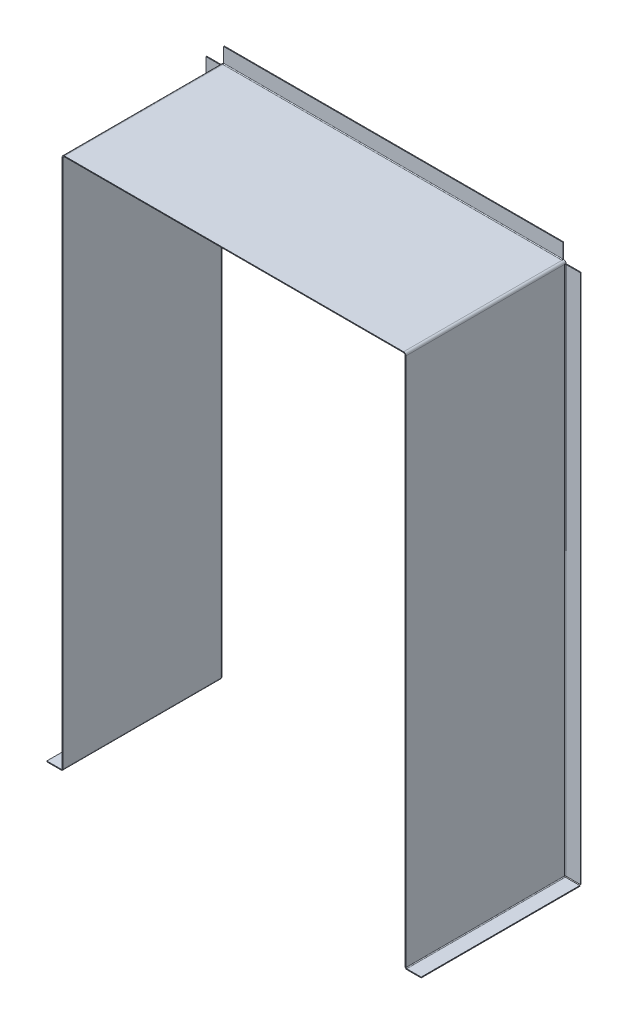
ISO-10303-21;
HEADER;
FILE_DESCRIPTION(('STEP AP214'),'2;1');
FILE_NAME('part.step','',(''),(''),'','','');
FILE_SCHEMA(('AUTOMOTIVE_DESIGN { 1 0 10303 214 1 1 1 1 }'));
ENDSEC;
DATA;
#1=APPLICATION_CONTEXT('core data for automotive mechanical design processes');
#2=APPLICATION_PROTOCOL_DEFINITION('international standard','automotive_design',2000,#1);
#3=PRODUCT_CONTEXT('',#1,'mechanical');
#4=PRODUCT('Part','Part','',(#3));
#5=PRODUCT_RELATED_PRODUCT_CATEGORY('part','',(#4));
#6=PRODUCT_DEFINITION_FORMATION('','',#4);
#7=PRODUCT_DEFINITION_CONTEXT('part definition',#1,'design');
#8=PRODUCT_DEFINITION('design','',#6,#7);
#9=PRODUCT_DEFINITION_SHAPE('','',#8);
#10=(LENGTH_UNIT() NAMED_UNIT(*) SI_UNIT(.MILLI.,.METRE.));
#11=(NAMED_UNIT(*) PLANE_ANGLE_UNIT() SI_UNIT($,.RADIAN.));
#12=(NAMED_UNIT(*) SI_UNIT($,.STERADIAN.) SOLID_ANGLE_UNIT());
#13=UNCERTAINTY_MEASURE_WITH_UNIT(LENGTH_MEASURE(1.E-05),#10,'distance_accuracy_value','');
#14=(GEOMETRIC_REPRESENTATION_CONTEXT(3) GLOBAL_UNCERTAINTY_ASSIGNED_CONTEXT((#13)) GLOBAL_UNIT_ASSIGNED_CONTEXT((#10,
#11,#12)) REPRESENTATION_CONTEXT('',''));
#15=CARTESIAN_POINT('',(0.,0.,0.));
#16=DIRECTION('',(0.,0.,1.));
#17=DIRECTION('',(1.,0.,0.));
#18=AXIS2_PLACEMENT_3D('',#15,#16,#17);
#19=CARTESIAN_POINT('',(-215.,-3.,2.));
#20=DIRECTION('',(0.,-1.,0.));
#21=DIRECTION('',(0.,0.,-1.));
#22=AXIS2_PLACEMENT_3D('',#19,#20,#21);
#23=PLANE('',#22);
#24=DIRECTION('',(0.,0.,-1.));
#25=VECTOR('',#24,1.);
#26=CARTESIAN_POINT('',(-214.,-3.,200.));
#27=LINE('',#26,#25);
#28=CARTESIAN_POINT('',(-214.,-3.,2.));
#29=VERTEX_POINT('',#28);
#30=CARTESIAN_POINT('',(-214.,-3.00000000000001,4.44089209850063E-13));
#31=VERTEX_POINT('',#30);
#32=EDGE_CURVE('E755',#29,#31,#27,.T.);
#33=ORIENTED_EDGE('',*,*,#32,.F.);
#34=CARTESIAN_POINT('',(-216.,-3.,2.));
#35=DIRECTION('',(0.,-1.,0.));
#36=DIRECTION('',(0.,0.,-1.));
#37=AXIS2_PLACEMENT_3D('',#34,#35,#36);
#38=CIRCLE('',#37,2.);
#39=CARTESIAN_POINT('',(-215.,-3.,0.267949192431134));
#40=VERTEX_POINT('',#39);
#41=EDGE_CURVE('E560',#29,#40,#38,.F.);
#42=ORIENTED_EDGE('',*,*,#41,.T.);
#43=DIRECTION('',(0.,0.,-1.));
#44=VECTOR('',#43,1.);
#45=CARTESIAN_POINT('',(-215.,-3.,2.));
#46=LINE('',#45,#44);
#47=CARTESIAN_POINT('',(-215.,-3.,0.));
#48=VERTEX_POINT('',#47);
#49=EDGE_CURVE('E687',#40,#48,#46,.T.);
#50=ORIENTED_EDGE('',*,*,#49,.T.);
#51=DIRECTION('',(-1.,0.,0.));
#52=VECTOR('',#51,1.);
#53=CARTESIAN_POINT('',(1171.93330769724,-3.,0.));
#54=LINE('',#53,#52);
#55=EDGE_CURVE('E779',#31,#48,#54,.T.);
#56=ORIENTED_EDGE('',*,*,#55,.F.);
#57=EDGE_LOOP('',(#33,#42,#50,#56));
#58=FACE_BOUND('',#57,.T.);
#59=ADVANCED_FACE('F139',(#58),#23,.T.);
#60=CARTESIAN_POINT('',(-212.,0.,2.22044604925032E-13));
#61=DIRECTION('',(1.,0.,0.));
#62=DIRECTION('',(0.,0.,-1.));
#63=AXIS2_PLACEMENT_3D('',#60,#61,#62);
#64=PLANE('',#63);
#65=DIRECTION('',(0.,0.,1.));
#66=VECTOR('',#65,1.);
#67=CARTESIAN_POINT('',(-212.,0.,2.22044604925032E-13));
#68=LINE('',#67,#66);
#69=CARTESIAN_POINT('',(-212.,0.,4.44089209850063E-13));
#70=VERTEX_POINT('',#69);
#71=CARTESIAN_POINT('',(-212.,0.,0.267949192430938));
#72=VERTEX_POINT('',#71);
#73=EDGE_CURVE('E692',#70,#72,#68,.T.);
#74=ORIENTED_EDGE('',*,*,#73,.T.);
#75=CARTESIAN_POINT('',(-212.,1.00000000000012,2.));
#76=DIRECTION('',(-1.,0.,0.));
#77=DIRECTION('',(0.,-1.,0.));
#78=AXIS2_PLACEMENT_3D('',#75,#76,#77);
#79=CIRCLE('',#78,2.00000000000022);
#80=CARTESIAN_POINT('',(-212.,-1.,2.));
#81=VERTEX_POINT('',#80);
#82=EDGE_CURVE('E13',#72,#81,#79,.T.);
#83=ORIENTED_EDGE('',*,*,#82,.T.);
#84=DIRECTION('',(0.,0.,-1.));
#85=VECTOR('',#84,1.);
#86=CARTESIAN_POINT('',(-212.,-1.,200.));
#87=LINE('',#86,#85);
#88=CARTESIAN_POINT('',(-212.,-1.,2.22105837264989E-13));
#89=VERTEX_POINT('',#88);
#90=EDGE_CURVE('E737',#81,#89,#87,.T.);
#91=ORIENTED_EDGE('',*,*,#90,.T.);
#92=DIRECTION('',(0.,1.,0.));
#93=VECTOR('',#92,1.);
#94=CARTESIAN_POINT('',(-212.,-937.605460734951,0.));
#95=LINE('',#94,#93);
#96=EDGE_CURVE('E741',#89,#70,#95,.T.);
#97=ORIENTED_EDGE('',*,*,#96,.T.);
#98=EDGE_LOOP('',(#74,#83,#91,#97));
#99=FACE_BOUND('',#98,.T.);
#100=ADVANCED_FACE('F797',(#99),#64,.T.);
#101=CARTESIAN_POINT('',(212.,-3.36536354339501E-13,2.));
#102=DIRECTION('',(-1.,0.,0.));
#103=DIRECTION('',(0.,0.,1.));
#104=AXIS2_PLACEMENT_3D('',#101,#102,#103);
#105=PLANE('',#104);
#106=DIRECTION('',(0.,0.,-1.));
#107=VECTOR('',#106,1.);
#108=CARTESIAN_POINT('',(212.,-0.999999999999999,200.));
#109=LINE('',#108,#107);
#110=CARTESIAN_POINT('',(212.,-0.999999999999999,2.));
#111=VERTEX_POINT('',#110);
#112=CARTESIAN_POINT('',(212.,-0.999999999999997,0.));
#113=VERTEX_POINT('',#112);
#114=EDGE_CURVE('E730',#111,#113,#109,.T.);
#115=ORIENTED_EDGE('',*,*,#114,.F.);
#116=CARTESIAN_POINT('',(212.,0.999999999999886,2.));
#117=DIRECTION('',(-1.,0.,0.));
#118=DIRECTION('',(0.,-1.,0.));
#119=AXIS2_PLACEMENT_3D('',#116,#117,#118);
#120=CIRCLE('',#119,2.00000000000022);
#121=CARTESIAN_POINT('',(212.,-2.37383590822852E-13,0.267949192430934));
#122=VERTEX_POINT('',#121);
#123=EDGE_CURVE('E810',#111,#122,#120,.F.);
#124=ORIENTED_EDGE('',*,*,#123,.T.);
#125=DIRECTION('',(0.,0.,-1.));
#126=VECTOR('',#125,1.);
#127=CARTESIAN_POINT('',(212.,-3.36536354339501E-13,2.));
#128=LINE('',#127,#126);
#129=CARTESIAN_POINT('',(212.,-2.22044604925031E-13,0.));
#130=VERTEX_POINT('',#129);
#131=EDGE_CURVE('E691',#122,#130,#128,.T.);
#132=ORIENTED_EDGE('',*,*,#131,.T.);
#133=DIRECTION('',(0.,1.,0.));
#134=VECTOR('',#133,1.);
#135=CARTESIAN_POINT('',(212.,-937.605460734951,0.));
#136=LINE('',#135,#134);
#137=EDGE_CURVE('E748',#113,#130,#136,.T.);
#138=ORIENTED_EDGE('',*,*,#137,.F.);
#139=EDGE_LOOP('',(#115,#124,#132,#138));
#140=FACE_BOUND('',#139,.T.);
#141=ADVANCED_FACE('F1024',(#140),#105,.T.);
#142=CARTESIAN_POINT('',(215.,-3.,0.));
#143=DIRECTION('',(0.,-1.,0.));
#144=DIRECTION('',(0.,0.,-1.));
#145=AXIS2_PLACEMENT_3D('',#142,#143,#144);
#146=PLANE('',#145);
#147=DIRECTION('',(0.,0.,1.));
#148=VECTOR('',#147,1.);
#149=CARTESIAN_POINT('',(215.,-3.,0.));
#150=LINE('',#149,#148);
#151=CARTESIAN_POINT('',(215.,-3.,0.));
#152=VERTEX_POINT('',#151);
#153=CARTESIAN_POINT('',(215.,-3.,0.267949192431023));
#154=VERTEX_POINT('',#153);
#155=EDGE_CURVE('E697',#152,#154,#150,.T.);
#156=ORIENTED_EDGE('',*,*,#155,.T.);
#157=CARTESIAN_POINT('',(216.,-3.,2.));
#158=DIRECTION('',(0.,1.,0.));
#159=DIRECTION('',(0.,0.,1.));
#160=AXIS2_PLACEMENT_3D('',#157,#158,#159);
#161=CIRCLE('',#160,2.);
#162=CARTESIAN_POINT('',(214.,-3.,2.));
#163=VERTEX_POINT('',#162);
#164=EDGE_CURVE('E148',#154,#163,#161,.T.);
#165=ORIENTED_EDGE('',*,*,#164,.T.);
#166=DIRECTION('',(0.,0.,-1.));
#167=VECTOR('',#166,1.);
#168=CARTESIAN_POINT('',(214.,-3.,200.));
#169=LINE('',#168,#167);
#170=CARTESIAN_POINT('',(214.,-3.,0.));
#171=VERTEX_POINT('',#170);
#172=EDGE_CURVE('E756',#163,#171,#169,.T.);
#173=ORIENTED_EDGE('',*,*,#172,.T.);
#174=DIRECTION('',(1.,0.,0.));
#175=VECTOR('',#174,1.);
#176=CARTESIAN_POINT('',(-1171.93330769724,-3.,0.));
#177=LINE('',#176,#175);
#178=EDGE_CURVE('E763',#171,#152,#177,.T.);
#179=ORIENTED_EDGE('',*,*,#178,.T.);
#180=EDGE_LOOP('',(#156,#165,#173,#179));
#181=FACE_BOUND('',#180,.T.);
#182=ADVANCED_FACE('F1017',(#181),#146,.T.);
#183=CARTESIAN_POINT('',(-215.,-667.,200.));
#184=DIRECTION('',(-1.,0.,0.));
#185=DIRECTION('',(0.,0.,1.));
#186=AXIS2_PLACEMENT_3D('',#183,#184,#185);
#187=PLANE('',#186);
#188=DIRECTION('',(0.,-1.,0.));
#189=VECTOR('',#188,1.);
#190=CARTESIAN_POINT('',(-215.,-665.292893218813,2.));
#191=LINE('',#190,#189);
#192=CARTESIAN_POINT('',(-215.,-665.,2.));
#193=VERTEX_POINT('',#192);
#194=CARTESIAN_POINT('',(-215.,-3.,2.));
#195=VERTEX_POINT('',#194);
#196=EDGE_CURVE('E569',#193,#195,#191,.F.);
#197=ORIENTED_EDGE('',*,*,#196,.F.);
#198=DIRECTION('',(0.,0.,1.));
#199=VECTOR('',#198,1.);
#200=CARTESIAN_POINT('',(-215.,-665.,200.));
#201=LINE('',#200,#199);
#202=CARTESIAN_POINT('',(-215.,-665.,200.));
#203=VERTEX_POINT('',#202);
#204=EDGE_CURVE('E437',#203,#193,#201,.F.);
#205=ORIENTED_EDGE('',*,*,#204,.F.);
#206=DIRECTION('',(0.,1.,0.));
#207=VECTOR('',#206,1.);
#208=CARTESIAN_POINT('',(-215.,-667.,200.));
#209=LINE('',#208,#207);
#210=CARTESIAN_POINT('',(-215.,-3.,200.));
#211=VERTEX_POINT('',#210);
#212=EDGE_CURVE('E773',#203,#211,#209,.T.);
#213=ORIENTED_EDGE('',*,*,#212,.T.);
#214=DIRECTION('',(0.,0.,-1.));
#215=VECTOR('',#214,1.);
#216=CARTESIAN_POINT('',(-215.,-3.,200.));
#217=LINE('',#216,#215);
#218=EDGE_CURVE('E770',#211,#195,#217,.T.);
#219=ORIENTED_EDGE('',*,*,#218,.T.);
#220=EDGE_LOOP('',(#197,#205,#213,#219));
#221=FACE_BOUND('',#220,.T.);
#222=ADVANCED_FACE('F988',(#221),#187,.T.);
#223=CARTESIAN_POINT('',(-214.,-667.,200.));
#224=DIRECTION('',(-1.,0.,0.));
#225=DIRECTION('',(0.,0.,1.));
#226=AXIS2_PLACEMENT_3D('',#223,#224,#225);
#227=PLANE('',#226);
#228=DIRECTION('',(0.,0.,1.));
#229=VECTOR('',#228,1.);
#230=CARTESIAN_POINT('',(-214.,-665.,200.));
#231=LINE('',#230,#229);
#232=CARTESIAN_POINT('',(-214.,-665.,200.));
#233=VERTEX_POINT('',#232);
#234=CARTESIAN_POINT('',(-214.,-665.,2.));
#235=VERTEX_POINT('',#234);
#236=EDGE_CURVE('E433',#233,#235,#231,.F.);
#237=ORIENTED_EDGE('',*,*,#236,.T.);
#238=DIRECTION('',(0.,-1.,0.));
#239=VECTOR('',#238,1.);
#240=CARTESIAN_POINT('',(-214.,-665.292893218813,2.));
#241=LINE('',#240,#239);
#242=EDGE_CURVE('E968',#235,#29,#241,.F.);
#243=ORIENTED_EDGE('',*,*,#242,.T.);
#244=CARTESIAN_POINT('',(-214.,-3.,200.));
#245=VERTEX_POINT('',#244);
#246=EDGE_CURVE('E143',#245,#29,#27,.T.);
#247=ORIENTED_EDGE('',*,*,#246,.F.);
#248=DIRECTION('',(0.,1.,0.));
#249=VECTOR('',#248,1.);
#250=CARTESIAN_POINT('',(-214.,-667.,200.));
#251=LINE('',#250,#249);
#252=EDGE_CURVE('E775',#233,#245,#251,.T.);
#253=ORIENTED_EDGE('',*,*,#252,.F.);
#254=EDGE_LOOP('',(#237,#243,#247,#253));
#255=FACE_BOUND('',#254,.T.);
#256=ADVANCED_FACE('F141',(#255),#227,.F.);
#257=CARTESIAN_POINT('',(1171.93330769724,-667.,200.));
#258=DIRECTION('',(0.,0.,1.));
#259=DIRECTION('',(0.,1.,0.));
#260=AXIS2_PLACEMENT_3D('',#257,#258,#259);
#261=PLANE('',#260);
#262=ORIENTED_EDGE('',*,*,#212,.F.);
#263=DIRECTION('',(1.,0.,0.));
#264=VECTOR('',#263,1.);
#265=CARTESIAN_POINT('',(-215.,-665.,200.));
#266=LINE('',#265,#264);
#267=EDGE_CURVE('E929',#203,#233,#266,.T.);
#268=ORIENTED_EDGE('',*,*,#267,.T.);
#269=ORIENTED_EDGE('',*,*,#252,.T.);
#270=DIRECTION('',(-1.,0.,0.));
#271=VECTOR('',#270,1.);
#272=CARTESIAN_POINT('',(1171.93330769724,-3.,200.));
#273=LINE('',#272,#271);
#274=EDGE_CURVE('E777',#245,#211,#273,.T.);
#275=ORIENTED_EDGE('',*,*,#274,.T.);
#276=EDGE_LOOP('',(#262,#268,#269,#275));
#277=FACE_BOUND('',#276,.T.);
#278=ADVANCED_FACE('F992',(#277),#261,.T.);
#279=CARTESIAN_POINT('',(215.,-3.,200.));
#280=DIRECTION('',(1.,0.,0.));
#281=DIRECTION('',(0.,0.,-1.));
#282=AXIS2_PLACEMENT_3D('',#279,#280,#281);
#283=PLANE('',#282);
#284=DIRECTION('',(0.,-1.,0.));
#285=VECTOR('',#284,1.);
#286=CARTESIAN_POINT('',(215.,-3.,200.));
#287=LINE('',#286,#285);
#288=CARTESIAN_POINT('',(215.,-3.,200.));
#289=VERTEX_POINT('',#288);
#290=CARTESIAN_POINT('',(215.,-665.,200.));
#291=VERTEX_POINT('',#290);
#292=EDGE_CURVE('E760',#289,#291,#287,.T.);
#293=ORIENTED_EDGE('',*,*,#292,.T.);
#294=DIRECTION('',(0.,0.,-1.));
#295=VECTOR('',#294,1.);
#296=CARTESIAN_POINT('',(215.,-665.,1.70710678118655));
#297=LINE('',#296,#295);
#298=CARTESIAN_POINT('',(215.,-665.,2.00000000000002));
#299=VERTEX_POINT('',#298);
#300=EDGE_CURVE('E522',#299,#291,#297,.F.);
#301=ORIENTED_EDGE('',*,*,#300,.F.);
#302=DIRECTION('',(0.,1.,0.));
#303=VECTOR('',#302,1.);
#304=CARTESIAN_POINT('',(215.,-3.,2.));
#305=LINE('',#304,#303);
#306=CARTESIAN_POINT('',(215.,-3.,2.));
#307=VERTEX_POINT('',#306);
#308=EDGE_CURVE('E864',#307,#299,#305,.F.);
#309=ORIENTED_EDGE('',*,*,#308,.F.);
#310=DIRECTION('',(0.,0.,-1.));
#311=VECTOR('',#310,1.);
#312=CARTESIAN_POINT('',(215.,-3.,200.));
#313=LINE('',#312,#311);
#314=EDGE_CURVE('E766',#289,#307,#313,.T.);
#315=ORIENTED_EDGE('',*,*,#314,.F.);
#316=EDGE_LOOP('',(#293,#301,#309,#315));
#317=FACE_BOUND('',#316,.T.);
#318=ADVANCED_FACE('F1120',(#317),#283,.T.);
#319=CARTESIAN_POINT('',(214.,-3.,200.));
#320=DIRECTION('',(1.,0.,0.));
#321=DIRECTION('',(0.,0.,-1.));
#322=AXIS2_PLACEMENT_3D('',#319,#320,#321);
#323=PLANE('',#322);
#324=DIRECTION('',(0.,0.,-1.));
#325=VECTOR('',#324,1.);
#326=CARTESIAN_POINT('',(214.,-665.,1.70710678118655));
#327=LINE('',#326,#325);
#328=CARTESIAN_POINT('',(214.,-665.,2.));
#329=VERTEX_POINT('',#328);
#330=CARTESIAN_POINT('',(214.,-665.,200.));
#331=VERTEX_POINT('',#330);
#332=EDGE_CURVE('E510',#329,#331,#327,.F.);
#333=ORIENTED_EDGE('',*,*,#332,.T.);
#334=DIRECTION('',(0.,1.,0.));
#335=VECTOR('',#334,1.);
#336=CARTESIAN_POINT('',(214.,-3.,200.));
#337=LINE('',#336,#335);
#338=CARTESIAN_POINT('',(214.,-3.,200.));
#339=VERTEX_POINT('',#338);
#340=EDGE_CURVE('E757',#339,#331,#337,.F.);
#341=ORIENTED_EDGE('',*,*,#340,.F.);
#342=EDGE_CURVE('E752',#339,#163,#169,.T.);
#343=ORIENTED_EDGE('',*,*,#342,.T.);
#344=DIRECTION('',(0.,1.,0.));
#345=VECTOR('',#344,1.);
#346=CARTESIAN_POINT('',(214.,-3.,2.));
#347=LINE('',#346,#345);
#348=EDGE_CURVE('E678',#163,#329,#347,.F.);
#349=ORIENTED_EDGE('',*,*,#348,.T.);
#350=EDGE_LOOP('',(#333,#341,#343,#349));
#351=FACE_BOUND('',#350,.T.);
#352=ADVANCED_FACE('F901',(#351),#323,.F.);
#353=CARTESIAN_POINT('',(-212.,-1.,200.));
#354=DIRECTION('',(0.,1.,0.));
#355=DIRECTION('',(0.,0.,1.));
#356=AXIS2_PLACEMENT_3D('',#353,#354,#355);
#357=PLANE('',#356);
#358=DIRECTION('',(-1.,0.,0.));
#359=VECTOR('',#358,1.);
#360=CARTESIAN_POINT('',(-212.,-1.00000000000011,2.));
#361=LINE('',#360,#359);
#362=EDGE_CURVE('E804',#81,#111,#361,.F.);
#363=ORIENTED_EDGE('',*,*,#362,.T.);
#364=CARTESIAN_POINT('',(212.,-0.999999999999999,200.));
#365=VERTEX_POINT('',#364);
#366=EDGE_CURVE('E731',#365,#111,#109,.T.);
#367=ORIENTED_EDGE('',*,*,#366,.F.);
#368=DIRECTION('',(1.,0.,0.));
#369=VECTOR('',#368,1.);
#370=CARTESIAN_POINT('',(-212.,-1.,200.));
#371=LINE('',#370,#369);
#372=CARTESIAN_POINT('',(-212.,-1.,200.));
#373=VERTEX_POINT('',#372);
#374=EDGE_CURVE('E734',#373,#365,#371,.T.);
#375=ORIENTED_EDGE('',*,*,#374,.F.);
#376=EDGE_CURVE('E738',#373,#81,#87,.T.);
#377=ORIENTED_EDGE('',*,*,#376,.T.);
#378=EDGE_LOOP('',(#363,#367,#375,#377));
#379=FACE_BOUND('',#378,.T.);
#380=ADVANCED_FACE('F803',(#379),#357,.F.);
#381=CARTESIAN_POINT('',(-212.,0.,200.));
#382=DIRECTION('',(0.,1.,0.));
#383=DIRECTION('',(0.,0.,1.));
#384=AXIS2_PLACEMENT_3D('',#381,#382,#383);
#385=PLANE('',#384);
#386=DIRECTION('',(0.,0.,-1.));
#387=VECTOR('',#386,1.);
#388=CARTESIAN_POINT('',(212.,0.,200.));
#389=LINE('',#388,#387);
#390=CARTESIAN_POINT('',(212.,-2.22044604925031E-13,200.));
#391=VERTEX_POINT('',#390);
#392=CARTESIAN_POINT('',(212.,0.,2.));
#393=VERTEX_POINT('',#392);
#394=EDGE_CURVE('E727',#391,#393,#389,.T.);
#395=ORIENTED_EDGE('',*,*,#394,.T.);
#396=DIRECTION('',(-1.,0.,0.));
#397=VECTOR('',#396,1.);
#398=CARTESIAN_POINT('',(-212.,-1.06685493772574E-13,2.));
#399=LINE('',#398,#397);
#400=CARTESIAN_POINT('',(-212.,0.,2.));
#401=VERTEX_POINT('',#400);
#402=EDGE_CURVE('E822',#401,#393,#399,.F.);
#403=ORIENTED_EDGE('',*,*,#402,.F.);
#404=DIRECTION('',(0.,0.,-1.));
#405=VECTOR('',#404,1.);
#406=CARTESIAN_POINT('',(-212.,0.,200.));
#407=LINE('',#406,#405);
#408=CARTESIAN_POINT('',(-212.,0.,200.));
#409=VERTEX_POINT('',#408);
#410=EDGE_CURVE('E718',#409,#401,#407,.T.);
#411=ORIENTED_EDGE('',*,*,#410,.F.);
#412=DIRECTION('',(1.,0.,0.));
#413=VECTOR('',#412,1.);
#414=CARTESIAN_POINT('',(-212.,0.,200.));
#415=LINE('',#414,#413);
#416=EDGE_CURVE('E724',#409,#391,#415,.T.);
#417=ORIENTED_EDGE('',*,*,#416,.T.);
#418=EDGE_LOOP('',(#395,#403,#411,#417));
#419=FACE_BOUND('',#418,.T.);
#420=ADVANCED_FACE('F1001',(#419),#385,.T.);
#421=CARTESIAN_POINT('',(-1171.93330769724,-3.,200.));
#422=DIRECTION('',(0.,0.,1.));
#423=DIRECTION('',(0.,-1.,0.));
#424=AXIS2_PLACEMENT_3D('',#421,#422,#423);
#425=PLANE('',#424);
#426=DIRECTION('',(-1.,0.,0.));
#427=VECTOR('',#426,1.);
#428=CARTESIAN_POINT('',(215.,-665.,200.));
#429=LINE('',#428,#427);
#430=EDGE_CURVE('E525',#291,#331,#429,.T.);
#431=ORIENTED_EDGE('',*,*,#430,.F.);
#432=ORIENTED_EDGE('',*,*,#292,.F.);
#433=DIRECTION('',(1.,0.,0.));
#434=VECTOR('',#433,1.);
#435=CARTESIAN_POINT('',(-1171.93330769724,-3.,200.));
#436=LINE('',#435,#434);
#437=EDGE_CURVE('E751',#339,#289,#436,.T.);
#438=ORIENTED_EDGE('',*,*,#437,.F.);
#439=ORIENTED_EDGE('',*,*,#340,.T.);
#440=EDGE_LOOP('',(#431,#432,#438,#439));
#441=FACE_BOUND('',#440,.T.);
#442=ADVANCED_FACE('F1115',(#441),#425,.T.);
#443=CARTESIAN_POINT('',(-212.,-937.605460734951,200.));
#444=DIRECTION('',(0.,0.,1.));
#445=DIRECTION('',(1.,0.,0.));
#446=AXIS2_PLACEMENT_3D('',#443,#444,#445);
#447=PLANE('',#446);
#448=DIRECTION('',(0.,1.,0.));
#449=VECTOR('',#448,1.);
#450=CARTESIAN_POINT('',(212.,-937.605460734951,200.));
#451=LINE('',#450,#449);
#452=EDGE_CURVE('E746',#365,#391,#451,.T.);
#453=ORIENTED_EDGE('',*,*,#452,.T.);
#454=ORIENTED_EDGE('',*,*,#416,.F.);
#455=DIRECTION('',(0.,1.,0.));
#456=VECTOR('',#455,1.);
#457=CARTESIAN_POINT('',(-212.,-937.605460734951,200.));
#458=LINE('',#457,#456);
#459=EDGE_CURVE('E744',#373,#409,#458,.T.);
#460=ORIENTED_EDGE('',*,*,#459,.F.);
#461=ORIENTED_EDGE('',*,*,#374,.T.);
#462=EDGE_LOOP('',(#453,#454,#460,#461));
#463=FACE_BOUND('',#462,.T.);
#464=ADVANCED_FACE('F1004',(#463),#447,.T.);
#465=CARTESIAN_POINT('',(212.,-3.,0.));
#466=DIRECTION('',(0.,0.,-1.));
#467=DIRECTION('',(-1.,0.,0.));
#468=AXIS2_PLACEMENT_3D('',#465,#466,#467);
#469=PLANE('',#468);
#470=ORIENTED_EDGE('',*,*,#178,.F.);
#471=CARTESIAN_POINT('',(212.,-3.,0.));
#472=DIRECTION('',(0.,0.,1.));
#473=DIRECTION('',(1.,0.,0.));
#474=AXIS2_PLACEMENT_3D('',#471,#472,#473);
#475=CIRCLE('',#474,2.);
#476=EDGE_CURVE('E707',#171,#113,#475,.T.);
#477=ORIENTED_EDGE('',*,*,#476,.T.);
#478=ORIENTED_EDGE('',*,*,#137,.T.);
#479=CARTESIAN_POINT('',(212.,-3.,0.));
#480=DIRECTION('',(0.,0.,1.));
#481=DIRECTION('',(1.,0.,0.));
#482=AXIS2_PLACEMENT_3D('',#479,#480,#481);
#483=CIRCLE('',#482,3.);
#484=EDGE_CURVE('E711',#152,#130,#483,.T.);
#485=ORIENTED_EDGE('',*,*,#484,.F.);
#486=EDGE_LOOP('',(#470,#477,#478,#485));
#487=FACE_BOUND('',#486,.T.);
#488=ADVANCED_FACE('F1021',(#487),#469,.T.);
#489=CARTESIAN_POINT('',(212.,-3.,200.));
#490=DIRECTION('',(0.,0.,1.));
#491=DIRECTION('',(1.,0.,0.));
#492=AXIS2_PLACEMENT_3D('',#489,#490,#491);
#493=PLANE('',#492);
#494=CARTESIAN_POINT('',(212.,-3.,200.));
#495=DIRECTION('',(0.,0.,1.));
#496=DIRECTION('',(1.,0.,0.));
#497=AXIS2_PLACEMENT_3D('',#494,#495,#496);
#498=CIRCLE('',#497,2.);
#499=EDGE_CURVE('E715',#365,#339,#498,.F.);
#500=ORIENTED_EDGE('',*,*,#499,.T.);
#501=ORIENTED_EDGE('',*,*,#437,.T.);
#502=CARTESIAN_POINT('',(212.,-3.,200.));
#503=DIRECTION('',(0.,0.,1.));
#504=DIRECTION('',(1.,0.,0.));
#505=AXIS2_PLACEMENT_3D('',#502,#503,#504);
#506=CIRCLE('',#505,3.);
#507=EDGE_CURVE('E714',#391,#289,#506,.F.);
#508=ORIENTED_EDGE('',*,*,#507,.F.);
#509=ORIENTED_EDGE('',*,*,#452,.F.);
#510=EDGE_LOOP('',(#500,#501,#508,#509));
#511=FACE_BOUND('',#510,.T.);
#512=ADVANCED_FACE('F1008',(#511),#493,.T.);
#513=CARTESIAN_POINT('',(212.,-3.,-1771.18238379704));
#514=DIRECTION('',(0.,0.,1.));
#515=DIRECTION('',(1.,0.,0.));
#516=AXIS2_PLACEMENT_3D('',#513,#514,#515);
#517=CYLINDRICAL_SURFACE('',#516,3.);
#518=ORIENTED_EDGE('',*,*,#394,.F.);
#519=ORIENTED_EDGE('',*,*,#507,.T.);
#520=ORIENTED_EDGE('',*,*,#314,.T.);
#521=EDGE_CURVE('E165',#154,#307,#150,.T.);
#522=ORIENTED_EDGE('',*,*,#521,.F.);
#523=ORIENTED_EDGE('',*,*,#155,.F.);
#524=ORIENTED_EDGE('',*,*,#484,.T.);
#525=ORIENTED_EDGE('',*,*,#131,.F.);
#526=EDGE_CURVE('E694',#393,#122,#128,.T.);
#527=ORIENTED_EDGE('',*,*,#526,.F.);
#528=EDGE_LOOP('',(#518,#519,#520,#522,#523,#524,#525,#527));
#529=FACE_BOUND('',#528,.T.);
#530=ADVANCED_FACE('F1019',(#529),#517,.T.);
#531=CARTESIAN_POINT('',(212.,-3.,-1771.18238379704));
#532=DIRECTION('',(0.,0.,1.));
#533=DIRECTION('',(1.,0.,0.));
#534=AXIS2_PLACEMENT_3D('',#531,#532,#533);
#535=CYLINDRICAL_SURFACE('',#534,2.);
#536=ORIENTED_EDGE('',*,*,#366,.T.);
#537=ORIENTED_EDGE('',*,*,#114,.T.);
#538=ORIENTED_EDGE('',*,*,#476,.F.);
#539=ORIENTED_EDGE('',*,*,#172,.F.);
#540=ORIENTED_EDGE('',*,*,#342,.F.);
#541=ORIENTED_EDGE('',*,*,#499,.F.);
#542=EDGE_LOOP('',(#536,#537,#538,#539,#540,#541));
#543=FACE_BOUND('',#542,.T.);
#544=ADVANCED_FACE('F1011',(#543),#535,.F.);
#545=CARTESIAN_POINT('',(-212.,-3.,0.));
#546=DIRECTION('',(0.,0.,-1.));
#547=DIRECTION('',(-1.,0.,0.));
#548=AXIS2_PLACEMENT_3D('',#545,#546,#547);
#549=PLANE('',#548);
#550=ORIENTED_EDGE('',*,*,#96,.F.);
#551=CARTESIAN_POINT('',(-212.,-3.,4.44089209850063E-13));
#552=DIRECTION('',(0.,0.,-1.));
#553=DIRECTION('',(-1.,0.,0.));
#554=AXIS2_PLACEMENT_3D('',#551,#552,#553);
#555=CIRCLE('',#554,2.);
#556=EDGE_CURVE('E704',#89,#31,#555,.F.);
#557=ORIENTED_EDGE('',*,*,#556,.T.);
#558=ORIENTED_EDGE('',*,*,#55,.T.);
#559=CARTESIAN_POINT('',(-212.,-3.,4.44089209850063E-13));
#560=DIRECTION('',(0.,0.,-1.));
#561=DIRECTION('',(-1.,0.,0.));
#562=AXIS2_PLACEMENT_3D('',#559,#560,#561);
#563=CIRCLE('',#562,3.);
#564=EDGE_CURVE('E703',#70,#48,#563,.F.);
#565=ORIENTED_EDGE('',*,*,#564,.F.);
#566=EDGE_LOOP('',(#550,#557,#558,#565));
#567=FACE_BOUND('',#566,.T.);
#568=ADVANCED_FACE('F795',(#567),#549,.T.);
#569=CARTESIAN_POINT('',(-212.,-3.,200.));
#570=DIRECTION('',(0.,0.,1.));
#571=DIRECTION('',(1.,0.,0.));
#572=AXIS2_PLACEMENT_3D('',#569,#570,#571);
#573=PLANE('',#572);
#574=ORIENTED_EDGE('',*,*,#274,.F.);
#575=CARTESIAN_POINT('',(-212.,-3.,200.));
#576=DIRECTION('',(0.,0.,-1.));
#577=DIRECTION('',(-1.,0.,0.));
#578=AXIS2_PLACEMENT_3D('',#575,#576,#577);
#579=CIRCLE('',#578,2.);
#580=EDGE_CURVE('E699',#245,#373,#579,.T.);
#581=ORIENTED_EDGE('',*,*,#580,.T.);
#582=ORIENTED_EDGE('',*,*,#459,.T.);
#583=CARTESIAN_POINT('',(-212.,-3.,200.));
#584=DIRECTION('',(0.,0.,-1.));
#585=DIRECTION('',(-1.,0.,0.));
#586=AXIS2_PLACEMENT_3D('',#583,#584,#585);
#587=CIRCLE('',#586,3.);
#588=EDGE_CURVE('E700',#211,#409,#587,.T.);
#589=ORIENTED_EDGE('',*,*,#588,.F.);
#590=EDGE_LOOP('',(#574,#581,#582,#589));
#591=FACE_BOUND('',#590,.T.);
#592=ADVANCED_FACE('F996',(#591),#573,.T.);
#593=CARTESIAN_POINT('',(-212.,-3.,1497.59551294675));
#594=DIRECTION('',(0.,0.,-1.));
#595=DIRECTION('',(-1.,0.,0.));
#596=AXIS2_PLACEMENT_3D('',#593,#594,#595);
#597=CYLINDRICAL_SURFACE('',#596,3.);
#598=ORIENTED_EDGE('',*,*,#588,.T.);
#599=ORIENTED_EDGE('',*,*,#410,.T.);
#600=EDGE_CURVE('E157',#72,#401,#68,.T.);
#601=ORIENTED_EDGE('',*,*,#600,.F.);
#602=ORIENTED_EDGE('',*,*,#73,.F.);
#603=ORIENTED_EDGE('',*,*,#564,.T.);
#604=ORIENTED_EDGE('',*,*,#49,.F.);
#605=EDGE_CURVE('E688',#195,#40,#46,.T.);
#606=ORIENTED_EDGE('',*,*,#605,.F.);
#607=ORIENTED_EDGE('',*,*,#218,.F.);
#608=EDGE_LOOP('',(#598,#599,#601,#602,#603,#604,#606,#607));
#609=FACE_BOUND('',#608,.T.);
#610=ADVANCED_FACE('F998',(#609),#597,.T.);
#611=CARTESIAN_POINT('',(-212.,-3.,1497.59551294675));
#612=DIRECTION('',(0.,0.,-1.));
#613=DIRECTION('',(-1.,0.,0.));
#614=AXIS2_PLACEMENT_3D('',#611,#612,#613);
#615=CYLINDRICAL_SURFACE('',#614,2.);
#616=ORIENTED_EDGE('',*,*,#580,.F.);
#617=ORIENTED_EDGE('',*,*,#246,.T.);
#618=ORIENTED_EDGE('',*,*,#32,.T.);
#619=ORIENTED_EDGE('',*,*,#556,.F.);
#620=ORIENTED_EDGE('',*,*,#90,.F.);
#621=ORIENTED_EDGE('',*,*,#376,.F.);
#622=EDGE_LOOP('',(#616,#617,#618,#619,#620,#621));
#623=FACE_BOUND('',#622,.T.);
#624=ADVANCED_FACE('F790',(#623),#615,.F.);
#625=CARTESIAN_POINT('',(213.99,-665.,2.));
#626=CARTESIAN_POINT('',(213.99,-665.024412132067,1.7368445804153));
#627=CARTESIAN_POINT('',(214.042314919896,-665.048815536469,1.47388675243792));
#628=CARTESIAN_POINT('',(214.243689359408,-665.097631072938,0.987725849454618));
#629=CARTESIAN_POINT('',(214.392669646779,-665.122038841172,0.764761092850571));
#630=CARTESIAN_POINT('',(214.76476109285,-665.170854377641,0.392669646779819));
#631=CARTESIAN_POINT('',(214.987725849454,-665.195262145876,0.243689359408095));
#632=CARTESIAN_POINT('',(215.473886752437,-665.244077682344,0.0423149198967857));
#633=CARTESIAN_POINT('',(215.736844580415,-665.268481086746,-0.00999999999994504));
#634=CARTESIAN_POINT('',(215.999999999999,-665.292893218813,-0.0100000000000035));
#635=CARTESIAN_POINT('',(214.,-665.,2.));
#636=CARTESIAN_POINT('',(214.,-665.024412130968,1.7381538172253));
#637=CARTESIAN_POINT('',(214.052054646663,-665.048815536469,1.47650423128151));
#638=CARTESIAN_POINT('',(214.252427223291,-665.097631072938,0.992762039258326));
#639=CARTESIAN_POINT('',(214.400666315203,-665.122038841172,0.770906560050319));
#640=CARTESIAN_POINT('',(214.77090656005,-665.170854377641,0.4006663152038));
#641=CARTESIAN_POINT('',(214.992762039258,-665.195262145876,0.252427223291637));
#642=CARTESIAN_POINT('',(215.476504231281,-665.244077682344,0.0520546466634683));
#643=CARTESIAN_POINT('',(215.738153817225,-665.268481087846,0.));
#644=CARTESIAN_POINT('',(215.999999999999,-665.292893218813,0.));
#645=CARTESIAN_POINT('',(215.,-665.,2.));
#646=CARTESIAN_POINT('',(215.,-665.024412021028,1.86907749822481));
#647=CARTESIAN_POINT('',(215.026027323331,-665.048815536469,1.73825211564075));
#648=CARTESIAN_POINT('',(215.126213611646,-665.097631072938,1.49638101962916));
#649=CARTESIAN_POINT('',(215.200333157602,-665.122038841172,1.38545328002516));
#650=CARTESIAN_POINT('',(215.385453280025,-665.170854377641,1.2003331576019));
#651=CARTESIAN_POINT('',(215.496381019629,-665.195262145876,1.12621361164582));
#652=CARTESIAN_POINT('',(215.73825211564,-665.244077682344,1.02602732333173));
#653=CARTESIAN_POINT('',(215.869077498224,-665.268481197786,1.00000000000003));
#654=CARTESIAN_POINT('',(216.,-665.292893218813,0.999999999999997));
#655=CARTESIAN_POINT('',(215.0101,-665.,2.));
#656=CARTESIAN_POINT('',(215.0101,-665.024412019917,1.87039982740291));
#657=CARTESIAN_POINT('',(215.035864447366,-665.048815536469,1.74089576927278));
#658=CARTESIAN_POINT('',(215.135038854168,-665.097631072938,1.50146757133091));
#659=CARTESIAN_POINT('',(215.20840979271,-665.122038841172,1.3916602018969));
#660=CARTESIAN_POINT('',(215.391660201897,-665.170854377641,1.20840979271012));
#661=CARTESIAN_POINT('',(215.501467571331,-665.195262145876,1.13503885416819));
#662=CARTESIAN_POINT('',(215.740895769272,-665.244077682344,1.03586444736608));
#663=CARTESIAN_POINT('',(215.870399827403,-665.268481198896,1.01010000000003));
#664=CARTESIAN_POINT('',(216.,-665.292893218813,1.0101));
#665=B_SPLINE_SURFACE_WITH_KNOTS('',1,3,((#625,#626,#627,#628,#629,#630,#631,#632,#633,#634),
(#635,#636,#637,#638,#639,#640,#641,#642,#643,#644),(#645,#646,#647,#648,#649,#650,#651,#652,
#653,#654),(#655,#656,#657,#658,#659,#660,#661,#662,#663,#664)),.UNSPECIFIED.,.F.,.F.,.F.,(2,1,
1,2),(4,2,2,2,4),(-0.01,0.,1.,1.0101),(0.,0.25,0.5,0.75,1.),.UNSPECIFIED.);
#666=DIRECTION('',(0.,0.,1.));
#667=VECTOR('',#666,1.);
#668=CARTESIAN_POINT('',(216.,-665.292893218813,1.));
#669=LINE('',#668,#667);
#670=CARTESIAN_POINT('',(216.,-665.292893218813,0.));
#671=VERTEX_POINT('',#670);
#672=CARTESIAN_POINT('',(216.,-665.292893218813,0.999999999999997));
#673=VERTEX_POINT('',#672);
#674=EDGE_CURVE('E829',#671,#673,#669,.T.);
#675=CARTESIAN_POINT('',(215.,-665.,2.));
#676=CARTESIAN_POINT('',(214.999999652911,-665.00305097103,1.98363752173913));
#677=CARTESIAN_POINT('',(215.000401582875,-665.006101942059,1.96727507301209));
#678=CARTESIAN_POINT('',(215.002007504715,-665.012203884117,1.9345895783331));
#679=CARTESIAN_POINT('',(215.003211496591,-665.015254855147,1.91826653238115));
#680=CARTESIAN_POINT('',(215.006419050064,-665.021356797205,1.88569918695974));
#681=CARTESIAN_POINT('',(215.008422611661,-665.024407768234,1.86945488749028));
#682=CARTESIAN_POINT('',(215.013224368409,-665.030509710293,1.83708416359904));
#683=CARTESIAN_POINT('',(215.016022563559,-665.033560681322,1.82095773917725));
#684=CARTESIAN_POINT('',(215.022406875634,-665.039662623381,1.78886161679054));
#685=CARTESIAN_POINT('',(215.025992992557,-665.04271359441,1.77289191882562));
#686=CARTESIAN_POINT('',(215.033944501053,-665.048815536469,1.74114772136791));
#687=CARTESIAN_POINT('',(215.038309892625,-665.051866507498,1.72537322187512));
#688=CARTESIAN_POINT('',(215.04780943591,-665.057968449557,1.69405742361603));
#689=CARTESIAN_POINT('',(215.052943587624,-665.061019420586,1.67851612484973));
#690=CARTESIAN_POINT('',(215.063968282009,-665.067121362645,1.64770416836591));
#691=CARTESIAN_POINT('',(215.06985882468,-665.070172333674,1.63243351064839));
#692=CARTESIAN_POINT('',(215.082382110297,-665.076274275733,1.60219962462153));
#693=CARTESIAN_POINT('',(215.089014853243,-665.079325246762,1.5872363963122));
#694=CARTESIAN_POINT('',(215.10300656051,-665.085427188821,1.55765341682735));
#695=CARTESIAN_POINT('',(215.110365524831,-665.08847815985,1.54303366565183));
#696=CARTESIAN_POINT('',(215.125791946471,-665.094580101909,1.51417286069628));
#697=CARTESIAN_POINT('',(215.13385940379,-665.097631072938,1.49993180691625));
#698=CARTESIAN_POINT('',(215.150683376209,-665.103733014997,1.47186270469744));
#699=CARTESIAN_POINT('',(215.15943989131,-665.106783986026,1.45803465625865));
#700=CARTESIAN_POINT('',(215.177620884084,-665.112885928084,1.43082487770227));
#701=CARTESIAN_POINT('',(215.187045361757,-665.115936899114,1.41744314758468));
#702=CARTESIAN_POINT('',(215.206539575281,-665.122038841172,1.3911582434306));
#703=CARTESIAN_POINT('',(215.216609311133,-665.125089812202,1.37825506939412));
#704=CARTESIAN_POINT('',(215.237369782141,-665.13119175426,1.35295836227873));
#705=CARTESIAN_POINT('',(215.248060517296,-665.134242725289,1.34056482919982));
#706=CARTESIAN_POINT('',(215.270037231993,-665.140344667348,1.31631726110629));
#707=CARTESIAN_POINT('',(215.281323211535,-665.143395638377,1.30446322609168));
#708=CARTESIAN_POINT('',(215.304463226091,-665.149497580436,1.28132321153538));
#709=CARTESIAN_POINT('',(215.316317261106,-665.152548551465,1.2700372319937));
#710=CARTESIAN_POINT('',(215.340564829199,-665.158650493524,1.24806051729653));
#711=CARTESIAN_POINT('',(215.352958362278,-665.161701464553,1.23736978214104));
#712=CARTESIAN_POINT('',(215.378255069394,-665.167803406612,1.21660931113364));
#713=CARTESIAN_POINT('',(215.39115824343,-665.170854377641,1.20653957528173));
#714=CARTESIAN_POINT('',(215.417443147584,-665.1769563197,1.18704536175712));
#715=CARTESIAN_POINT('',(215.430824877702,-665.180007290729,1.17762088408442));
#716=CARTESIAN_POINT('',(215.458034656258,-665.186109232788,1.15943989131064));
#717=CARTESIAN_POINT('',(215.471862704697,-665.189160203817,1.15068337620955));
#718=CARTESIAN_POINT('',(215.499931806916,-665.195262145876,1.13385940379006));
#719=CARTESIAN_POINT('',(215.514172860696,-665.198313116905,1.12579194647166));
#720=CARTESIAN_POINT('',(215.543033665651,-665.204415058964,1.11036552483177));
#721=CARTESIAN_POINT('',(215.557653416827,-665.207466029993,1.10300656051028));
#722=CARTESIAN_POINT('',(215.587236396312,-665.213567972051,1.08901485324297));
#723=CARTESIAN_POINT('',(215.602199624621,-665.216618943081,1.08238211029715));
#724=CARTESIAN_POINT('',(215.632433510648,-665.222720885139,1.0698588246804));
#725=CARTESIAN_POINT('',(215.647704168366,-665.225771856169,1.06396828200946));
#726=CARTESIAN_POINT('',(215.678516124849,-665.231873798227,1.0529435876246));
#727=CARTESIAN_POINT('',(215.694057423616,-665.234924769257,1.04780943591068));
#728=CARTESIAN_POINT('',(215.725373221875,-665.241026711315,1.038309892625));
#729=CARTESIAN_POINT('',(215.741147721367,-665.244077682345,1.03394450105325));
#730=CARTESIAN_POINT('',(215.772891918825,-665.250179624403,1.02599299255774));
#731=CARTESIAN_POINT('',(215.78886161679,-665.253230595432,1.02240687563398));
#732=CARTESIAN_POINT('',(215.820957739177,-665.259332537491,1.01602256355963));
#733=CARTESIAN_POINT('',(215.837084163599,-665.26238350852,1.01322436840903));
#734=CARTESIAN_POINT('',(215.86945488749,-665.268485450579,1.00842261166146));
#735=CARTESIAN_POINT('',(215.885699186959,-665.271536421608,1.00641905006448));
#736=CARTESIAN_POINT('',(215.918266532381,-665.277638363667,1.00321149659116));
#737=CARTESIAN_POINT('',(215.934589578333,-665.280689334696,1.00200750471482));
#738=CARTESIAN_POINT('',(215.967275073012,-665.286791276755,1.00040158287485));
#739=CARTESIAN_POINT('',(215.983637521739,-665.289842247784,0.999999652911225));
#740=CARTESIAN_POINT('',(216.,-665.292893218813,0.999999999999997));
#741=B_SPLINE_CURVE_WITH_KNOTS('',3,(#675,#676,#677,#678,#679,#680,#681,#682,#683,#684,#685,
#686,#687,#688,#689,#690,#691,#692,#693,#694,#695,#696,#697,#698,#699,#700,#701,#702,#703,#704,
#705,#706,#707,#708,#709,#710,#711,#712,#713,#714,#715,#716,#717,#718,#719,#720,#721,#722,#723,
#724,#725,#726,#727,#728,#729,#730,#731,#732,#733,#734,#735,#736,#737,#738,#739,#740),
.UNSPECIFIED.,.F.,.F.,(4,2,2,2,2,2,2,2,2,2,2,2,2,2,2,2,2,2,2,2,2,2,2,2,2,2,2,2,2,2,2,2,4),(0.,
0.0499285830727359,0.0998571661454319,0.14978574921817,0.199714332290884,0.249642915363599,
0.29957149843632,0.349500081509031,0.399428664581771,0.449357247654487,0.499285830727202,
0.549214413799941,0.599142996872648,0.649071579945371,0.699000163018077,0.748928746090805,
0.798857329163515,0.848785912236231,0.898714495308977,0.948643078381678,0.998571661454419,
1.04850024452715,1.09842882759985,1.14835741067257,1.19828599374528,1.24821457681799,
1.29814315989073,1.34807174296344,1.39800032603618,1.44792890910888,1.49785749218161,
1.54778607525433,1.59771465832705),.UNSPECIFIED.);
#742=EDGE_CURVE('E861',#299,#673,#741,.T.);
#743=DIRECTION('',(-1.,0.,0.));
#744=VECTOR('',#743,1.);
#745=CARTESIAN_POINT('',(215.,-665.,2.));
#746=LINE('',#745,#744);
#747=EDGE_CURVE('E677',#299,#329,#746,.T.);
#748=CARTESIAN_POINT('',(214.,-665.,2.));
#749=CARTESIAN_POINT('',(213.999999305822,-665.00305097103,1.96727504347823));
#750=CARTESIAN_POINT('',(214.00080316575,-665.006101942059,1.93455014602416));
#751=CARTESIAN_POINT('',(214.004015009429,-665.012203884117,1.8691791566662));
#752=CARTESIAN_POINT('',(214.006422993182,-665.015254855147,1.83653306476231));
#753=CARTESIAN_POINT('',(214.012838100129,-665.021356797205,1.77139837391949));
#754=CARTESIAN_POINT('',(214.016845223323,-665.024407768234,1.73890977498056));
#755=CARTESIAN_POINT('',(214.026448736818,-665.030509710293,1.67416832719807));
#756=CARTESIAN_POINT('',(214.032045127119,-665.033560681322,1.6419154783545));
#757=CARTESIAN_POINT('',(214.044813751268,-665.039662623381,1.57772323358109));
#758=CARTESIAN_POINT('',(214.051985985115,-665.04271359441,1.54578383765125));
#759=CARTESIAN_POINT('',(214.067889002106,-665.048815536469,1.48229544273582));
#760=CARTESIAN_POINT('',(214.07661978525,-665.051866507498,1.45074644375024));
#761=CARTESIAN_POINT('',(214.095618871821,-665.057968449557,1.38811484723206));
#762=CARTESIAN_POINT('',(214.105887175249,-665.061019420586,1.35703224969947));
#763=CARTESIAN_POINT('',(214.127936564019,-665.067121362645,1.29540833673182));
#764=CARTESIAN_POINT('',(214.13971764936,-665.070172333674,1.26486702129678));
#765=CARTESIAN_POINT('',(214.164764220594,-665.076274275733,1.20439924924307));
#766=CARTESIAN_POINT('',(214.178029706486,-665.079325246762,1.17447279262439));
#767=CARTESIAN_POINT('',(214.20601312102,-665.085427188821,1.1153068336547));
#768=CARTESIAN_POINT('',(214.220731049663,-665.08847815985,1.08606733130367));
#769=CARTESIAN_POINT('',(214.251583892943,-665.094580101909,1.02834572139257));
#770=CARTESIAN_POINT('',(214.26771880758,-665.097631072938,0.999863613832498));
#771=CARTESIAN_POINT('',(214.301366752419,-665.103733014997,0.943725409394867));
#772=CARTESIAN_POINT('',(214.318879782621,-665.106783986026,0.916069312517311));
#773=CARTESIAN_POINT('',(214.355241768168,-665.112885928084,0.861649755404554));
#774=CARTESIAN_POINT('',(214.374090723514,-665.115936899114,0.834886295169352));
#775=CARTESIAN_POINT('',(214.413079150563,-665.122038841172,0.782316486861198));
#776=CARTESIAN_POINT('',(214.433218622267,-665.125089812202,0.756510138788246));
#777=CARTESIAN_POINT('',(214.474739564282,-665.13119175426,0.705916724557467));
#778=CARTESIAN_POINT('',(214.496121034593,-665.134242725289,0.681129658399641));
#779=CARTESIAN_POINT('',(214.540074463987,-665.140344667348,0.632634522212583));
#780=CARTESIAN_POINT('',(214.56264642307,-665.143395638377,0.608926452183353));
#781=CARTESIAN_POINT('',(214.608926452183,-665.149497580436,0.562646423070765));
#782=CARTESIAN_POINT('',(214.632634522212,-665.152548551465,0.540074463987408));
#783=CARTESIAN_POINT('',(214.681129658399,-665.158650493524,0.496121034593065));
#784=CARTESIAN_POINT('',(214.705916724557,-665.161701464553,0.474739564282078));
#785=CARTESIAN_POINT('',(214.756510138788,-665.167803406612,0.433218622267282));
#786=CARTESIAN_POINT('',(214.782316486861,-665.170854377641,0.413079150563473));
#787=CARTESIAN_POINT('',(214.834886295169,-665.1769563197,0.374090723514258));
#788=CARTESIAN_POINT('',(214.861649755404,-665.180007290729,0.355241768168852));
#789=CARTESIAN_POINT('',(214.916069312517,-665.186109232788,0.318879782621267));
#790=CARTESIAN_POINT('',(214.943725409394,-665.189160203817,0.301366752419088));
#791=CARTESIAN_POINT('',(214.999863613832,-665.195262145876,0.267718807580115));
#792=CARTESIAN_POINT('',(215.028345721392,-665.198313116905,0.251583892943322));
#793=CARTESIAN_POINT('',(215.086067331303,-665.204415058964,0.220731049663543));
#794=CARTESIAN_POINT('',(215.115306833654,-665.207466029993,0.206013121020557));
#795=CARTESIAN_POINT('',(215.174472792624,-665.213567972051,0.178029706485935));
#796=CARTESIAN_POINT('',(215.204399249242,-665.216618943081,0.164764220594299));
#797=CARTESIAN_POINT('',(215.264867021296,-665.222720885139,0.139717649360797));
#798=CARTESIAN_POINT('',(215.295408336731,-665.225771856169,0.127936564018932));
#799=CARTESIAN_POINT('',(215.357032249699,-665.231873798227,0.105887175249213));
#800=CARTESIAN_POINT('',(215.388114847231,-665.234924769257,0.0956188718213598));
#801=CARTESIAN_POINT('',(215.45074644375,-665.241026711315,0.0766197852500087));
#802=CARTESIAN_POINT('',(215.482295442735,-665.244077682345,0.0678890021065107));
#803=CARTESIAN_POINT('',(215.545783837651,-665.250179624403,0.0519859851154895));
#804=CARTESIAN_POINT('',(215.57772323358,-665.253230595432,0.0448137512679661));
#805=CARTESIAN_POINT('',(215.641915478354,-665.259332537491,0.0320451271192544));
#806=CARTESIAN_POINT('',(215.674168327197,-665.26238350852,0.0264487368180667));
#807=CARTESIAN_POINT('',(215.73890977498,-665.268485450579,0.0168452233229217));
#808=CARTESIAN_POINT('',(215.771398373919,-665.271536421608,0.012838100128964));
#809=CARTESIAN_POINT('',(215.836533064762,-665.277638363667,0.00642299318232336));
#810=CARTESIAN_POINT('',(215.869179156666,-665.280689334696,0.00401500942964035));
#811=CARTESIAN_POINT('',(215.934550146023,-665.286791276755,0.000803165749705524));
#812=CARTESIAN_POINT('',(215.967275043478,-665.289842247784,-6.94177546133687E-07));
#813=CARTESIAN_POINT('',(215.999999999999,-665.292893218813,0.));
#814=B_SPLINE_CURVE_WITH_KNOTS('',3,(#748,#749,#750,#751,#752,#753,#754,#755,#756,#757,#758,
#759,#760,#761,#762,#763,#764,#765,#766,#767,#768,#769,#770,#771,#772,#773,#774,#775,#776,#777,
#778,#779,#780,#781,#782,#783,#784,#785,#786,#787,#788,#789,#790,#791,#792,#793,#794,#795,#796,
#797,#798,#799,#800,#801,#802,#803,#804,#805,#806,#807,#808,#809,#810,#811,#812,#813),
.UNSPECIFIED.,.F.,.F.,(4,2,2,2,2,2,2,2,2,2,2,2,2,2,2,2,2,2,2,2,2,2,2,2,2,2,2,2,2,2,2,2,4),(0.,
0.098590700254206,0.19718140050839,0.295772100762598,0.394362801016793,0.492953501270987,
0.591544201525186,0.69013490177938,0.788725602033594,0.88731630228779,0.985907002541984,
1.08449770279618,1.18308840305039,1.28167910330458,1.38026980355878,1.47886050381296,
1.57745120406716,1.67604190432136,1.77463260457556,1.87322330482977,1.97181400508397,
2.07040470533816,2.16899540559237,2.26758610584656,2.36617680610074,2.46476750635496,
2.56335820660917,2.66194890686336,2.76053960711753,2.85913030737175,2.95772100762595,
3.05631170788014,3.15490240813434),.UNSPECIFIED.);
#815=EDGE_CURVE('E672',#329,#671,#814,.T.);
#816=ORIENTED_EDGE('',*,*,#674,.T.);
#817=ORIENTED_EDGE('',*,*,#742,.F.);
#818=ORIENTED_EDGE('',*,*,#747,.T.);
#819=ORIENTED_EDGE('',*,*,#815,.T.);
#820=EDGE_LOOP('',(#816,#817,#818,#819));
#821=FACE_BOUND('',#820,.T.);
#822=ADVANCED_FACE('F894',(#821),#665,.F.);
#823=CARTESIAN_POINT('',(216.,-3.,2.));
#824=DIRECTION('',(0.,-1.,0.));
#825=DIRECTION('',(0.,0.,-1.));
#826=AXIS2_PLACEMENT_3D('',#823,#824,#825);
#827=PLANE('',#826);
#828=CARTESIAN_POINT('',(216.,-3.,0.));
#829=VERTEX_POINT('',#828);
#830=EDGE_CURVE('E858',#829,#154,#161,.T.);
#831=ORIENTED_EDGE('',*,*,#830,.T.);
#832=ORIENTED_EDGE('',*,*,#521,.T.);
#833=CARTESIAN_POINT('',(216.,-3.,2.));
#834=DIRECTION('',(0.,1.,0.));
#835=DIRECTION('',(0.,0.,1.));
#836=AXIS2_PLACEMENT_3D('',#833,#834,#835);
#837=CIRCLE('',#836,1.);
#838=CARTESIAN_POINT('',(216.,-3.,0.999999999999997));
#839=VERTEX_POINT('',#838);
#840=EDGE_CURVE('E831',#839,#307,#837,.T.);
#841=ORIENTED_EDGE('',*,*,#840,.F.);
#842=DIRECTION('',(0.,0.,1.));
#843=VECTOR('',#842,1.);
#844=CARTESIAN_POINT('',(216.,-3.,1.));
#845=LINE('',#844,#843);
#846=EDGE_CURVE('E847',#839,#829,#845,.F.);
#847=ORIENTED_EDGE('',*,*,#846,.T.);
#848=EDGE_LOOP('',(#831,#832,#841,#847));
#849=FACE_BOUND('',#848,.T.);
#850=ADVANCED_FACE('F667',(#849),#827,.F.);
#851=CARTESIAN_POINT('',(216.,-3.,2.));
#852=DIRECTION('',(0.,1.,0.));
#853=DIRECTION('',(0.,0.,-1.));
#854=AXIS2_PLACEMENT_3D('',#851,#852,#853);
#855=CYLINDRICAL_SURFACE('',#854,2.);
#856=ORIENTED_EDGE('',*,*,#348,.F.);
#857=ORIENTED_EDGE('',*,*,#164,.F.);
#858=ORIENTED_EDGE('',*,*,#830,.F.);
#859=DIRECTION('',(0.,1.,0.));
#860=VECTOR('',#859,1.);
#861=CARTESIAN_POINT('',(216.,-667.,0.));
#862=LINE('',#861,#860);
#863=EDGE_CURVE('E845',#829,#671,#862,.F.);
#864=ORIENTED_EDGE('',*,*,#863,.T.);
#865=ORIENTED_EDGE('',*,*,#815,.F.);
#866=EDGE_LOOP('',(#856,#857,#858,#864,#865));
#867=FACE_BOUND('',#866,.T.);
#868=ADVANCED_FACE('F663',(#867),#855,.T.);
#869=CARTESIAN_POINT('',(216.,-3.,2.));
#870=DIRECTION('',(0.,1.,0.));
#871=DIRECTION('',(0.,0.,-1.));
#872=AXIS2_PLACEMENT_3D('',#869,#870,#871);
#873=CYLINDRICAL_SURFACE('',#872,1.);
#874=ORIENTED_EDGE('',*,*,#308,.T.);
#875=ORIENTED_EDGE('',*,*,#742,.T.);
#876=DIRECTION('',(0.,1.,0.));
#877=VECTOR('',#876,1.);
#878=CARTESIAN_POINT('',(216.,-667.,0.999999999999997));
#879=LINE('',#878,#877);
#880=EDGE_CURVE('E850',#673,#839,#879,.T.);
#881=ORIENTED_EDGE('',*,*,#880,.T.);
#882=ORIENTED_EDGE('',*,*,#840,.T.);
#883=EDGE_LOOP('',(#874,#875,#881,#882));
#884=FACE_BOUND('',#883,.T.);
#885=ADVANCED_FACE('F647',(#884),#873,.F.);
#886=CARTESIAN_POINT('',(215.,-665.292893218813,1.));
#887=DIRECTION('',(0.,-1.,0.));
#888=DIRECTION('',(1.,0.,0.));
#889=AXIS2_PLACEMENT_3D('',#886,#887,#888);
#890=PLANE('',#889);
#891=DIRECTION('',(-1.,0.,0.));
#892=VECTOR('',#891,1.);
#893=CARTESIAN_POINT('',(215.,-665.292893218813,0.));
#894=LINE('',#893,#892);
#895=CARTESIAN_POINT('',(234.,-665.292893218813,0.));
#896=VERTEX_POINT('',#895);
#897=EDGE_CURVE('E854',#671,#896,#894,.F.);
#898=ORIENTED_EDGE('',*,*,#897,.T.);
#899=DIRECTION('',(0.,0.,-1.));
#900=VECTOR('',#899,1.);
#901=CARTESIAN_POINT('',(234.,-665.292893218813,0.999999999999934));
#902=LINE('',#901,#900);
#903=CARTESIAN_POINT('',(234.,-665.292893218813,0.999999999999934));
#904=VERTEX_POINT('',#903);
#905=EDGE_CURVE('E852',#896,#904,#902,.F.);
#906=ORIENTED_EDGE('',*,*,#905,.T.);
#907=DIRECTION('',(1.,0.,0.));
#908=VECTOR('',#907,1.);
#909=CARTESIAN_POINT('',(-4.17144289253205E-13,-665.292893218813,1.00000000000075));
#910=LINE('',#909,#908);
#911=EDGE_CURVE('E818',#673,#904,#910,.T.);
#912=ORIENTED_EDGE('',*,*,#911,.F.);
#913=ORIENTED_EDGE('',*,*,#674,.F.);
#914=EDGE_LOOP('',(#898,#906,#912,#913));
#915=FACE_BOUND('',#914,.T.);
#916=ADVANCED_FACE('F643',(#915),#890,.T.);
#917=CARTESIAN_POINT('',(0.,0.,7.50701584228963E-13));
#918=DIRECTION('',(0.,0.,1.));
#919=DIRECTION('',(1.,0.,0.));
#920=AXIS2_PLACEMENT_3D('',#917,#918,#919);
#921=PLANE('',#920);
#922=ORIENTED_EDGE('',*,*,#897,.F.);
#923=ORIENTED_EDGE('',*,*,#863,.F.);
#924=DIRECTION('',(1.,0.,0.));
#925=VECTOR('',#924,1.);
#926=CARTESIAN_POINT('',(0.,-2.99999999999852,7.50701584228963E-13));
#927=LINE('',#926,#925);
#928=CARTESIAN_POINT('',(234.,-3.00000000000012,0.));
#929=VERTEX_POINT('',#928);
#930=EDGE_CURVE('E838',#829,#929,#927,.T.);
#931=ORIENTED_EDGE('',*,*,#930,.T.);
#932=DIRECTION('',(0.,-1.,0.));
#933=VECTOR('',#932,1.);
#934=CARTESIAN_POINT('',(234.,-1.4671998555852E-13,0.));
#935=LINE('',#934,#933);
#936=EDGE_CURVE('E835',#929,#896,#935,.T.);
#937=ORIENTED_EDGE('',*,*,#936,.T.);
#938=EDGE_LOOP('',(#922,#923,#931,#937));
#939=FACE_BOUND('',#938,.T.);
#940=ADVANCED_FACE('F646',(#939),#921,.F.);
#941=CARTESIAN_POINT('',(0.,0.,1.00000000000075));
#942=DIRECTION('',(0.,0.,1.));
#943=DIRECTION('',(1.,0.,0.));
#944=AXIS2_PLACEMENT_3D('',#941,#942,#943);
#945=PLANE('',#944);
#946=ORIENTED_EDGE('',*,*,#880,.F.);
#947=ORIENTED_EDGE('',*,*,#911,.T.);
#948=DIRECTION('',(0.,1.,0.));
#949=VECTOR('',#948,1.);
#950=CARTESIAN_POINT('',(234.,-667.,0.999999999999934));
#951=LINE('',#950,#949);
#952=CARTESIAN_POINT('',(234.,-3.00000000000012,0.999999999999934));
#953=VERTEX_POINT('',#952);
#954=EDGE_CURVE('E840',#953,#904,#951,.F.);
#955=ORIENTED_EDGE('',*,*,#954,.F.);
#956=DIRECTION('',(-1.,0.,0.));
#957=VECTOR('',#956,1.);
#958=CARTESIAN_POINT('',(234.,-3.00000000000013,0.999999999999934));
#959=LINE('',#958,#957);
#960=EDGE_CURVE('E843',#839,#953,#959,.F.);
#961=ORIENTED_EDGE('',*,*,#960,.F.);
#962=EDGE_LOOP('',(#946,#947,#955,#961));
#963=FACE_BOUND('',#962,.T.);
#964=ADVANCED_FACE('F651',(#963),#945,.T.);
#965=CARTESIAN_POINT('',(234.,-667.,0.));
#966=DIRECTION('',(-1.,0.,0.));
#967=DIRECTION('',(0.,0.,1.));
#968=AXIS2_PLACEMENT_3D('',#965,#966,#967);
#969=PLANE('',#968);
#970=ORIENTED_EDGE('',*,*,#905,.F.);
#971=ORIENTED_EDGE('',*,*,#936,.F.);
#972=DIRECTION('',(0.,0.,1.));
#973=VECTOR('',#972,1.);
#974=CARTESIAN_POINT('',(234.,-3.00000000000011,0.));
#975=LINE('',#974,#973);
#976=EDGE_CURVE('E832',#929,#953,#975,.T.);
#977=ORIENTED_EDGE('',*,*,#976,.T.);
#978=ORIENTED_EDGE('',*,*,#954,.T.);
#979=EDGE_LOOP('',(#970,#971,#977,#978));
#980=FACE_BOUND('',#979,.T.);
#981=ADVANCED_FACE('F655',(#980),#969,.F.);
#982=CARTESIAN_POINT('',(234.,-3.00000000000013,0.));
#983=DIRECTION('',(0.,-1.,0.));
#984=DIRECTION('',(1.,0.,0.));
#985=AXIS2_PLACEMENT_3D('',#982,#983,#984);
#986=PLANE('',#985);
#987=ORIENTED_EDGE('',*,*,#846,.F.);
#988=ORIENTED_EDGE('',*,*,#960,.T.);
#989=ORIENTED_EDGE('',*,*,#976,.F.);
#990=ORIENTED_EDGE('',*,*,#930,.F.);
#991=EDGE_LOOP('',(#987,#988,#989,#990));
#992=FACE_BOUND('',#991,.T.);
#993=ADVANCED_FACE('F638',(#992),#986,.F.);
#994=CARTESIAN_POINT('',(212.,0.999999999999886,2.));
#995=DIRECTION('',(1.,0.,0.));
#996=DIRECTION('',(0.,1.,0.));
#997=AXIS2_PLACEMENT_3D('',#994,#995,#996);
#998=PLANE('',#997);
#999=CARTESIAN_POINT('',(212.,0.999999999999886,2.));
#1000=DIRECTION('',(-1.,0.,0.));
#1001=DIRECTION('',(0.,-1.,0.));
#1002=AXIS2_PLACEMENT_3D('',#999,#1000,#1001);
#1003=CIRCLE('',#1002,1.00000000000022);
#1004=CARTESIAN_POINT('',(212.,0.999999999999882,0.999999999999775));
#1005=VERTEX_POINT('',#1004);
#1006=EDGE_CURVE('E814',#393,#1005,#1003,.F.);
#1007=ORIENTED_EDGE('',*,*,#1006,.F.);
#1008=ORIENTED_EDGE('',*,*,#526,.T.);
#1009=CARTESIAN_POINT('',(212.,0.999999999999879,-2.25514051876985E-13));
#1010=VERTEX_POINT('',#1009);
#1011=EDGE_CURVE('E811',#122,#1010,#120,.F.);
#1012=ORIENTED_EDGE('',*,*,#1011,.T.);
#1013=DIRECTION('',(0.,0.,1.));
#1014=VECTOR('',#1013,1.);
#1015=CARTESIAN_POINT('',(212.,0.999999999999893,-2.15061642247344E-13));
#1016=LINE('',#1015,#1014);
#1017=EDGE_CURVE('E816',#1005,#1010,#1016,.F.);
#1018=ORIENTED_EDGE('',*,*,#1017,.F.);
#1019=EDGE_LOOP('',(#1007,#1008,#1012,#1018));
#1020=FACE_BOUND('',#1019,.T.);
#1021=ADVANCED_FACE('F635',(#1020),#998,.T.);
#1022=CARTESIAN_POINT('',(-212.,1.00000000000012,2.));
#1023=DIRECTION('',(1.,0.,0.));
#1024=DIRECTION('',(0.,1.,0.));
#1025=AXIS2_PLACEMENT_3D('',#1022,#1023,#1024);
#1026=PLANE('',#1025);
#1027=CARTESIAN_POINT('',(-212.,1.00000000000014,2.18569649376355E-13));
#1028=VERTEX_POINT('',#1027);
#1029=EDGE_CURVE('E150',#1028,#72,#79,.T.);
#1030=ORIENTED_EDGE('',*,*,#1029,.T.);
#1031=ORIENTED_EDGE('',*,*,#600,.T.);
#1032=CARTESIAN_POINT('',(-212.,1.00000000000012,2.));
#1033=DIRECTION('',(-1.,0.,0.));
#1034=DIRECTION('',(0.,-1.,0.));
#1035=AXIS2_PLACEMENT_3D('',#1032,#1033,#1034);
#1036=CIRCLE('',#1035,1.00000000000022);
#1037=CARTESIAN_POINT('',(-212.,1.00000000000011,0.999999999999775));
#1038=VERTEX_POINT('',#1037);
#1039=EDGE_CURVE('E825',#1038,#401,#1036,.T.);
#1040=ORIENTED_EDGE('',*,*,#1039,.F.);
#1041=DIRECTION('',(0.,0.,1.));
#1042=VECTOR('',#1041,1.);
#1043=CARTESIAN_POINT('',(-212.,1.00000000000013,1.00000000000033));
#1044=LINE('',#1043,#1042);
#1045=EDGE_CURVE('E1034',#1038,#1028,#1044,.F.);
#1046=ORIENTED_EDGE('',*,*,#1045,.T.);
#1047=EDGE_LOOP('',(#1030,#1031,#1040,#1046));
#1048=FACE_BOUND('',#1047,.T.);
#1049=ADVANCED_FACE('F630',(#1048),#1026,.F.);
#1050=CARTESIAN_POINT('',(-212.,1.00000000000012,2.));
#1051=DIRECTION('',(-1.,0.,0.));
#1052=DIRECTION('',(0.,0.,-1.));
#1053=AXIS2_PLACEMENT_3D('',#1050,#1051,#1052);
#1054=CYLINDRICAL_SURFACE('',#1053,2.00000000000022);
#1055=ORIENTED_EDGE('',*,*,#362,.F.);
#1056=ORIENTED_EDGE('',*,*,#82,.F.);
#1057=ORIENTED_EDGE('',*,*,#1029,.F.);
#1058=DIRECTION('',(-1.,0.,0.));
#1059=VECTOR('',#1058,1.);
#1060=CARTESIAN_POINT('',(212.,0.999999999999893,-2.25514051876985E-13));
#1061=LINE('',#1060,#1059);
#1062=EDGE_CURVE('E1036',#1028,#1010,#1061,.F.);
#1063=ORIENTED_EDGE('',*,*,#1062,.T.);
#1064=ORIENTED_EDGE('',*,*,#1011,.F.);
#1065=ORIENTED_EDGE('',*,*,#123,.F.);
#1066=EDGE_LOOP('',(#1055,#1056,#1057,#1063,#1064,#1065));
#1067=FACE_BOUND('',#1066,.T.);
#1068=ADVANCED_FACE('F627',(#1067),#1054,.T.);
#1069=CARTESIAN_POINT('',(-212.,1.00000000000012,2.));
#1070=DIRECTION('',(-1.,0.,0.));
#1071=DIRECTION('',(0.,0.,-1.));
#1072=AXIS2_PLACEMENT_3D('',#1069,#1070,#1071);
#1073=CYLINDRICAL_SURFACE('',#1072,1.00000000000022);
#1074=ORIENTED_EDGE('',*,*,#402,.T.);
#1075=ORIENTED_EDGE('',*,*,#1006,.T.);
#1076=DIRECTION('',(-1.,0.,0.));
#1077=VECTOR('',#1076,1.);
#1078=CARTESIAN_POINT('',(212.,0.999999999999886,0.999999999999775));
#1079=LINE('',#1078,#1077);
#1080=EDGE_CURVE('E1033',#1005,#1038,#1079,.T.);
#1081=ORIENTED_EDGE('',*,*,#1080,.T.);
#1082=ORIENTED_EDGE('',*,*,#1039,.T.);
#1083=EDGE_LOOP('',(#1074,#1075,#1081,#1082));
#1084=FACE_BOUND('',#1083,.T.);
#1085=ADVANCED_FACE('F625',(#1084),#1073,.F.);
#1086=CARTESIAN_POINT('',(-212.,19.0000000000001,1.55691431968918E-13));
#1087=DIRECTION('',(1.,0.,0.));
#1088=DIRECTION('',(0.,0.,-1.));
#1089=AXIS2_PLACEMENT_3D('',#1086,#1087,#1088);
#1090=PLANE('',#1089);
#1091=ORIENTED_EDGE('',*,*,#1045,.F.);
#1092=DIRECTION('',(0.,-1.,0.));
#1093=VECTOR('',#1092,1.);
#1094=CARTESIAN_POINT('',(-212.,19.0000000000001,1.00000000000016));
#1095=LINE('',#1094,#1093);
#1096=CARTESIAN_POINT('',(-212.,19.0000000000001,1.00000000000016));
#1097=VERTEX_POINT('',#1096);
#1098=EDGE_CURVE('E1040',#1038,#1097,#1095,.F.);
#1099=ORIENTED_EDGE('',*,*,#1098,.T.);
#1100=DIRECTION('',(0.,0.,1.));
#1101=VECTOR('',#1100,1.);
#1102=CARTESIAN_POINT('',(-212.,19.0000000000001,1.55691431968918E-13));
#1103=LINE('',#1102,#1101);
#1104=CARTESIAN_POINT('',(-212.,19.0000000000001,1.55706459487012E-13));
#1105=VERTEX_POINT('',#1104);
#1106=EDGE_CURVE('E828',#1105,#1097,#1103,.T.);
#1107=ORIENTED_EDGE('',*,*,#1106,.F.);
#1108=DIRECTION('',(0.,1.,0.));
#1109=VECTOR('',#1108,1.);
#1110=CARTESIAN_POINT('',(-212.,0.,2.22044604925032E-13));
#1111=LINE('',#1110,#1109);
#1112=EDGE_CURVE('E1046',#1028,#1105,#1111,.T.);
#1113=ORIENTED_EDGE('',*,*,#1112,.F.);
#1114=EDGE_LOOP('',(#1091,#1099,#1107,#1113));
#1115=FACE_BOUND('',#1114,.T.);
#1116=ADVANCED_FACE('F618',(#1115),#1090,.F.);
#1117=CARTESIAN_POINT('',(212.,-2.25536086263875E-13,-2.22044604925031E-13));
#1118=DIRECTION('',(-1.,0.,0.));
#1119=DIRECTION('',(0.,0.,1.));
#1120=AXIS2_PLACEMENT_3D('',#1117,#1118,#1119);
#1121=PLANE('',#1120);
#1122=ORIENTED_EDGE('',*,*,#1017,.T.);
#1123=DIRECTION('',(0.,-1.,0.));
#1124=VECTOR('',#1123,1.);
#1125=CARTESIAN_POINT('',(212.,0.,-2.22044604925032E-13));
#1126=LINE('',#1125,#1124);
#1127=CARTESIAN_POINT('',(212.,18.9999999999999,-2.88382750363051E-13));
#1128=VERTEX_POINT('',#1127);
#1129=EDGE_CURVE('E1050',#1128,#1010,#1126,.T.);
#1130=ORIENTED_EDGE('',*,*,#1129,.F.);
#1131=DIRECTION('',(0.,0.,1.));
#1132=VECTOR('',#1131,1.);
#1133=CARTESIAN_POINT('',(212.,18.9999999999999,-2.88382750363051E-13));
#1134=LINE('',#1133,#1132);
#1135=CARTESIAN_POINT('',(212.,18.9999999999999,0.999999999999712));
#1136=VERTEX_POINT('',#1135);
#1137=EDGE_CURVE('E1052',#1128,#1136,#1134,.T.);
#1138=ORIENTED_EDGE('',*,*,#1137,.T.);
#1139=DIRECTION('',(0.,1.,0.));
#1140=VECTOR('',#1139,1.);
#1141=CARTESIAN_POINT('',(212.,-2.22044604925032E-13,0.999999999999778));
#1142=LINE('',#1141,#1140);
#1143=EDGE_CURVE('E1044',#1136,#1005,#1142,.F.);
#1144=ORIENTED_EDGE('',*,*,#1143,.T.);
#1145=EDGE_LOOP('',(#1122,#1130,#1138,#1144));
#1146=FACE_BOUND('',#1145,.T.);
#1147=ADVANCED_FACE('F611',(#1146),#1121,.F.);
#1148=CARTESIAN_POINT('',(0.,0.,0.));
#1149=DIRECTION('',(0.,0.,1.));
#1150=DIRECTION('',(0.,-1.,0.));
#1151=AXIS2_PLACEMENT_3D('',#1148,#1149,#1150);
#1152=PLANE('',#1151);
#1153=ORIENTED_EDGE('',*,*,#1062,.F.);
#1154=ORIENTED_EDGE('',*,*,#1112,.T.);
#1155=DIRECTION('',(1.,0.,0.));
#1156=VECTOR('',#1155,1.);
#1157=CARTESIAN_POINT('',(0.,19.,0.));
#1158=LINE('',#1157,#1156);
#1159=EDGE_CURVE('E1048',#1105,#1128,#1158,.T.);
#1160=ORIENTED_EDGE('',*,*,#1159,.T.);
#1161=ORIENTED_EDGE('',*,*,#1129,.T.);
#1162=EDGE_LOOP('',(#1153,#1154,#1160,#1161));
#1163=FACE_BOUND('',#1162,.T.);
#1164=ADVANCED_FACE('F602',(#1163),#1152,.F.);
#1165=CARTESIAN_POINT('',(0.,0.,1.));
#1166=DIRECTION('',(0.,0.,1.));
#1167=DIRECTION('',(0.,-1.,0.));
#1168=AXIS2_PLACEMENT_3D('',#1165,#1166,#1167);
#1169=PLANE('',#1168);
#1170=ORIENTED_EDGE('',*,*,#1098,.F.);
#1171=ORIENTED_EDGE('',*,*,#1080,.F.);
#1172=ORIENTED_EDGE('',*,*,#1143,.F.);
#1173=DIRECTION('',(-1.,0.,0.));
#1174=VECTOR('',#1173,1.);
#1175=CARTESIAN_POINT('',(212.,18.9999999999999,0.999999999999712));
#1176=LINE('',#1175,#1174);
#1177=EDGE_CURVE('E1042',#1097,#1136,#1176,.F.);
#1178=ORIENTED_EDGE('',*,*,#1177,.F.);
#1179=EDGE_LOOP('',(#1170,#1171,#1172,#1178));
#1180=FACE_BOUND('',#1179,.T.);
#1181=ADVANCED_FACE('F610',(#1180),#1169,.T.);
#1182=CARTESIAN_POINT('',(212.,18.9999999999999,-2.88397777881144E-13));
#1183=DIRECTION('',(0.,-1.,0.));
#1184=DIRECTION('',(0.,0.,-1.));
#1185=AXIS2_PLACEMENT_3D('',#1182,#1183,#1184);
#1186=PLANE('',#1185);
#1187=ORIENTED_EDGE('',*,*,#1177,.T.);
#1188=ORIENTED_EDGE('',*,*,#1137,.F.);
#1189=ORIENTED_EDGE('',*,*,#1159,.F.);
#1190=ORIENTED_EDGE('',*,*,#1106,.T.);
#1191=EDGE_LOOP('',(#1187,#1188,#1189,#1190));
#1192=FACE_BOUND('',#1191,.T.);
#1193=ADVANCED_FACE('F595',(#1192),#1186,.F.);
#1194=CARTESIAN_POINT('',(-216.,-3.,2.));
#1195=DIRECTION('',(0.,1.,0.));
#1196=DIRECTION('',(0.,0.,1.));
#1197=AXIS2_PLACEMENT_3D('',#1194,#1195,#1196);
#1198=PLANE('',#1197);
#1199=CARTESIAN_POINT('',(-216.,-3.,2.));
#1200=DIRECTION('',(0.,-1.,0.));
#1201=DIRECTION('',(0.,0.,-1.));
#1202=AXIS2_PLACEMENT_3D('',#1199,#1200,#1201);
#1203=CIRCLE('',#1202,1.);
#1204=CARTESIAN_POINT('',(-216.,-3.,0.999999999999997));
#1205=VERTEX_POINT('',#1204);
#1206=EDGE_CURVE('E565',#195,#1205,#1203,.F.);
#1207=ORIENTED_EDGE('',*,*,#1206,.F.);
#1208=ORIENTED_EDGE('',*,*,#605,.T.);
#1209=CARTESIAN_POINT('',(-216.,-3.,0.));
#1210=VERTEX_POINT('',#1209);
#1211=EDGE_CURVE('E564',#40,#1210,#38,.F.);
#1212=ORIENTED_EDGE('',*,*,#1211,.T.);
#1213=DIRECTION('',(0.,0.,1.));
#1214=VECTOR('',#1213,1.);
#1215=CARTESIAN_POINT('',(-216.,-3.,0.));
#1216=LINE('',#1215,#1214);
#1217=EDGE_CURVE('E551',#1205,#1210,#1216,.F.);
#1218=ORIENTED_EDGE('',*,*,#1217,.F.);
#1219=EDGE_LOOP('',(#1207,#1208,#1212,#1218));
#1220=FACE_BOUND('',#1219,.T.);
#1221=ADVANCED_FACE('F591',(#1220),#1198,.T.);
#1222=CARTESIAN_POINT('',(-216.,-665.292893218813,-0.0100000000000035));
#1223=CARTESIAN_POINT('',(-215.736844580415,-665.268481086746,-0.0100000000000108));
#1224=CARTESIAN_POINT('',(-215.473886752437,-665.244077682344,0.0423149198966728));
#1225=CARTESIAN_POINT('',(-214.987725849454,-665.195262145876,0.243689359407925));
#1226=CARTESIAN_POINT('',(-214.76476109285,-665.170854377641,0.392669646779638));
#1227=CARTESIAN_POINT('',(-214.392669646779,-665.122038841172,0.764761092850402));
#1228=CARTESIAN_POINT('',(-214.243689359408,-665.097631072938,0.987725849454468));
#1229=CARTESIAN_POINT('',(-214.042314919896,-665.048815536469,1.47388675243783));
#1230=CARTESIAN_POINT('',(-213.99,-665.024412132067,1.73684458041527));
#1231=CARTESIAN_POINT('',(-213.99,-665.,2.));
#1232=CARTESIAN_POINT('',(-216.,-665.292893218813,0.));
#1233=CARTESIAN_POINT('',(-215.738153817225,-665.268481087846,0.));
#1234=CARTESIAN_POINT('',(-215.476504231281,-665.244077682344,0.0520546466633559));
#1235=CARTESIAN_POINT('',(-214.992762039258,-665.195262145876,0.252427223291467));
#1236=CARTESIAN_POINT('',(-214.77090656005,-665.170854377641,0.400666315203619));
#1237=CARTESIAN_POINT('',(-214.400666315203,-665.122038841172,0.770906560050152));
#1238=CARTESIAN_POINT('',(-214.252427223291,-665.097631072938,0.992762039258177));
#1239=CARTESIAN_POINT('',(-214.052054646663,-665.048815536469,1.47650423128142));
#1240=CARTESIAN_POINT('',(-214.,-665.024412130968,1.73815381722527));
#1241=CARTESIAN_POINT('',(-214.,-665.,2.));
#1242=CARTESIAN_POINT('',(-216.,-665.292893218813,0.999999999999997));
#1243=CARTESIAN_POINT('',(-215.869077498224,-665.268481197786,0.999999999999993));
#1244=CARTESIAN_POINT('',(-215.73825211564,-665.244077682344,1.02602732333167));
#1245=CARTESIAN_POINT('',(-215.496381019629,-665.195262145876,1.12621361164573));
#1246=CARTESIAN_POINT('',(-215.385453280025,-665.170854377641,1.20033315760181));
#1247=CARTESIAN_POINT('',(-215.200333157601,-665.122038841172,1.38545328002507));
#1248=CARTESIAN_POINT('',(-215.126213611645,-665.097631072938,1.49638101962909));
#1249=CARTESIAN_POINT('',(-215.026027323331,-665.048815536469,1.73825211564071));
#1250=CARTESIAN_POINT('',(-215.,-665.024412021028,1.86907749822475));
#1251=CARTESIAN_POINT('',(-215.,-665.,2.));
#1252=CARTESIAN_POINT('',(-216.,-665.292893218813,1.0101));
#1253=CARTESIAN_POINT('',(-215.870399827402,-665.268481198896,1.01009999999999));
#1254=CARTESIAN_POINT('',(-215.740895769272,-665.244077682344,1.03586444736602));
#1255=CARTESIAN_POINT('',(-215.50146757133,-665.195262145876,1.13503885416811));
#1256=CARTESIAN_POINT('',(-215.391660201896,-665.170854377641,1.20840979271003));
#1257=CARTESIAN_POINT('',(-215.20840979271,-665.122038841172,1.39166020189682));
#1258=CARTESIAN_POINT('',(-215.135038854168,-665.097631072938,1.50146757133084));
#1259=CARTESIAN_POINT('',(-215.035864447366,-665.048815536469,1.74089576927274));
#1260=CARTESIAN_POINT('',(-215.0101,-665.024412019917,1.87039982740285));
#1261=CARTESIAN_POINT('',(-215.0101,-665.,2.));
#1262=B_SPLINE_SURFACE_WITH_KNOTS('',1,3,((#1222,#1223,#1224,#1225,#1226,#1227,#1228,#1229,
#1230,#1231),(#1232,#1233,#1234,#1235,#1236,#1237,#1238,#1239,#1240,#1241),(#1242,#1243,#1244,
#1245,#1246,#1247,#1248,#1249,#1250,#1251),(#1252,#1253,#1254,#1255,#1256,#1257,#1258,#1259,
#1260,#1261)),.UNSPECIFIED.,.F.,.F.,.F.,(2,1,1,2),(4,2,2,2,4),(-0.01,0.,1.,1.0101),(0.,0.25,0.5,
0.75,1.),.UNSPECIFIED.);
#1263=CARTESIAN_POINT('',(-216.,-665.292893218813,0.999999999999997));
#1264=CARTESIAN_POINT('',(-215.983637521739,-665.289842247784,0.99999965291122));
#1265=CARTESIAN_POINT('',(-215.967275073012,-665.286791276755,1.00040158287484));
#1266=CARTESIAN_POINT('',(-215.934589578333,-665.280689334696,1.0020075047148));
#1267=CARTESIAN_POINT('',(-215.918266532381,-665.277638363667,1.00321149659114));
#1268=CARTESIAN_POINT('',(-215.885699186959,-665.271536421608,1.00641905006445));
#1269=CARTESIAN_POINT('',(-215.86945488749,-665.268485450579,1.00842261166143));
#1270=CARTESIAN_POINT('',(-215.837084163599,-665.26238350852,1.01322436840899));
#1271=CARTESIAN_POINT('',(-215.820957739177,-665.259332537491,1.01602256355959));
#1272=CARTESIAN_POINT('',(-215.78886161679,-665.253230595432,1.02240687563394));
#1273=CARTESIAN_POINT('',(-215.772891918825,-665.250179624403,1.0259929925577));
#1274=CARTESIAN_POINT('',(-215.741147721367,-665.244077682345,1.0339445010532));
#1275=CARTESIAN_POINT('',(-215.725373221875,-665.241026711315,1.03830989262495));
#1276=CARTESIAN_POINT('',(-215.694057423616,-665.234924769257,1.04780943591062));
#1277=CARTESIAN_POINT('',(-215.678516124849,-665.231873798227,1.05294358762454));
#1278=CARTESIAN_POINT('',(-215.647704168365,-665.225771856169,1.0639682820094));
#1279=CARTESIAN_POINT('',(-215.632433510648,-665.222720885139,1.06985882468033));
#1280=CARTESIAN_POINT('',(-215.602199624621,-665.216618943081,1.08238211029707));
#1281=CARTESIAN_POINT('',(-215.587236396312,-665.213567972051,1.08901485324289));
#1282=CARTESIAN_POINT('',(-215.557653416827,-665.207466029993,1.1030065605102));
#1283=CARTESIAN_POINT('',(-215.543033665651,-665.204415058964,1.11036552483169));
#1284=CARTESIAN_POINT('',(-215.514172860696,-665.198313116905,1.12579194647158));
#1285=CARTESIAN_POINT('',(-215.499931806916,-665.195262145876,1.13385940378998));
#1286=CARTESIAN_POINT('',(-215.471862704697,-665.189160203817,1.15068337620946));
#1287=CARTESIAN_POINT('',(-215.458034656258,-665.186109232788,1.15943989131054));
#1288=CARTESIAN_POINT('',(-215.430824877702,-665.180007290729,1.17762088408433));
#1289=CARTESIAN_POINT('',(-215.417443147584,-665.1769563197,1.18704536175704));
#1290=CARTESIAN_POINT('',(-215.39115824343,-665.170854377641,1.20653957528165));
#1291=CARTESIAN_POINT('',(-215.378255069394,-665.167803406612,1.21660931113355));
#1292=CARTESIAN_POINT('',(-215.352958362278,-665.161701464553,1.23736978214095));
#1293=CARTESIAN_POINT('',(-215.340564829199,-665.158650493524,1.24806051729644));
#1294=CARTESIAN_POINT('',(-215.316317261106,-665.152548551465,1.27003723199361));
#1295=CARTESIAN_POINT('',(-215.304463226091,-665.149497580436,1.28132321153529));
#1296=CARTESIAN_POINT('',(-215.281323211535,-665.143395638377,1.30446322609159));
#1297=CARTESIAN_POINT('',(-215.270037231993,-665.140344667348,1.3163172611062));
#1298=CARTESIAN_POINT('',(-215.248060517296,-665.134242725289,1.34056482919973));
#1299=CARTESIAN_POINT('',(-215.237369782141,-665.13119175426,1.35295836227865));
#1300=CARTESIAN_POINT('',(-215.216609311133,-665.125089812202,1.37825506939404));
#1301=CARTESIAN_POINT('',(-215.206539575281,-665.122038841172,1.39115824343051));
#1302=CARTESIAN_POINT('',(-215.187045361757,-665.115936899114,1.41744314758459));
#1303=CARTESIAN_POINT('',(-215.177620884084,-665.112885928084,1.4308248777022));
#1304=CARTESIAN_POINT('',(-215.15943989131,-665.106783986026,1.45803465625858));
#1305=CARTESIAN_POINT('',(-215.150683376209,-665.103733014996,1.47186270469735));
#1306=CARTESIAN_POINT('',(-215.13385940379,-665.097631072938,1.49993180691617));
#1307=CARTESIAN_POINT('',(-215.125791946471,-665.094580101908,1.51417286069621));
#1308=CARTESIAN_POINT('',(-215.110365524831,-665.08847815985,1.54303366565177));
#1309=CARTESIAN_POINT('',(-215.10300656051,-665.085427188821,1.55765341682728));
#1310=CARTESIAN_POINT('',(-215.089014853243,-665.079325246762,1.58723639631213));
#1311=CARTESIAN_POINT('',(-215.082382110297,-665.076274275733,1.60219962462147));
#1312=CARTESIAN_POINT('',(-215.06985882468,-665.070172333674,1.63243351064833));
#1313=CARTESIAN_POINT('',(-215.063968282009,-665.067121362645,1.64770416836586));
#1314=CARTESIAN_POINT('',(-215.052943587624,-665.061019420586,1.67851612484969));
#1315=CARTESIAN_POINT('',(-215.04780943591,-665.057968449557,1.69405742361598));
#1316=CARTESIAN_POINT('',(-215.038309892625,-665.051866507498,1.72537322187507));
#1317=CARTESIAN_POINT('',(-215.033944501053,-665.048815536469,1.74114772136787));
#1318=CARTESIAN_POINT('',(-215.025992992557,-665.04271359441,1.77289191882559));
#1319=CARTESIAN_POINT('',(-215.022406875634,-665.039662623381,1.78886161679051));
#1320=CARTESIAN_POINT('',(-215.016022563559,-665.033560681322,1.82095773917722));
#1321=CARTESIAN_POINT('',(-215.013224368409,-665.030509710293,1.83708416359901));
#1322=CARTESIAN_POINT('',(-215.008422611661,-665.024407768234,1.86945488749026));
#1323=CARTESIAN_POINT('',(-215.006419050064,-665.021356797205,1.88569918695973));
#1324=CARTESIAN_POINT('',(-215.003211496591,-665.015254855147,1.91826653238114));
#1325=CARTESIAN_POINT('',(-215.002007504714,-665.012203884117,1.93458957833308));
#1326=CARTESIAN_POINT('',(-215.000401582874,-665.006101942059,1.96727507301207));
#1327=CARTESIAN_POINT('',(-214.999999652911,-665.003050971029,1.98363752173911));
#1328=CARTESIAN_POINT('',(-215.,-665.,2.));
#1329=B_SPLINE_CURVE_WITH_KNOTS('',3,(#1263,#1264,#1265,#1266,#1267,#1268,#1269,#1270,#1271,
#1272,#1273,#1274,#1275,#1276,#1277,#1278,#1279,#1280,#1281,#1282,#1283,#1284,#1285,#1286,#1287,
#1288,#1289,#1290,#1291,#1292,#1293,#1294,#1295,#1296,#1297,#1298,#1299,#1300,#1301,#1302,#1303,
#1304,#1305,#1306,#1307,#1308,#1309,#1310,#1311,#1312,#1313,#1314,#1315,#1316,#1317,#1318,#1319,
#1320,#1321,#1322,#1323,#1324,#1325,#1326,#1327,#1328),.UNSPECIFIED.,.F.,.F.,(4,2,2,2,2,2,2,2,2,
2,2,2,2,2,2,2,2,2,2,2,2,2,2,2,2,2,2,2,2,2,2,2,4),(0.,0.049928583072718,0.0998571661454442,
0.149785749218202,0.199714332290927,0.249642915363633,0.29957149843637,0.349500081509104,
0.399428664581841,0.44935724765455,0.499285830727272,0.549214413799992,0.599142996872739,
0.649071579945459,0.699000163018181,0.748928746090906,0.798857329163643,0.848785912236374,
0.898714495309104,0.948643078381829,0.998571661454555,1.0485002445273,1.09842882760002,
1.14835741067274,1.19828599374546,1.24821457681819,1.29814315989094,1.34807174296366,
1.39800032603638,1.4479289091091,1.49785749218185,1.54778607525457,1.5977146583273),.UNSPECIFIED.);
#1330=CARTESIAN_POINT('',(-216.,-665.292893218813,0.999999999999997));
#1331=VERTEX_POINT('',#1330);
#1332=EDGE_CURVE('E532',#1331,#193,#1329,.T.);
#1333=DIRECTION('',(0.,0.,-1.));
#1334=VECTOR('',#1333,1.);
#1335=CARTESIAN_POINT('',(-216.,-665.292893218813,1.));
#1336=LINE('',#1335,#1334);
#1337=CARTESIAN_POINT('',(-216.,-665.292893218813,0.));
#1338=VERTEX_POINT('',#1337);
#1339=EDGE_CURVE('E529',#1338,#1331,#1336,.F.);
#1340=CARTESIAN_POINT('',(-216.,-665.292893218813,0.));
#1341=CARTESIAN_POINT('',(-215.967275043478,-665.289842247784,-6.9417755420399E-07));
#1342=CARTESIAN_POINT('',(-215.934550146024,-665.286791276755,0.000803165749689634));
#1343=CARTESIAN_POINT('',(-215.869179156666,-665.280689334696,0.00401500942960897));
#1344=CARTESIAN_POINT('',(-215.836533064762,-665.277638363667,0.00642299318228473));
#1345=CARTESIAN_POINT('',(-215.771398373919,-665.271536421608,0.0128381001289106));
#1346=CARTESIAN_POINT('',(-215.73890977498,-665.268485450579,0.0168452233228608));
#1347=CARTESIAN_POINT('',(-215.674168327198,-665.26238350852,0.0264487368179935));
#1348=CARTESIAN_POINT('',(-215.641915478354,-665.259332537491,0.0320451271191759));
#1349=CARTESIAN_POINT('',(-215.577723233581,-665.253230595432,0.0448137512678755));
#1350=CARTESIAN_POINT('',(-215.545783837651,-665.250179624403,0.0519859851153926));
#1351=CARTESIAN_POINT('',(-215.482295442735,-665.244077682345,0.0678890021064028));
#1352=CARTESIAN_POINT('',(-215.45074644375,-665.241026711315,0.0766197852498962));
#1353=CARTESIAN_POINT('',(-215.388114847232,-665.234924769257,0.0956188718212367));
#1354=CARTESIAN_POINT('',(-215.357032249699,-665.231873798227,0.105887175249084));
#1355=CARTESIAN_POINT('',(-215.295408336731,-665.225771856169,0.127936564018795));
#1356=CARTESIAN_POINT('',(-215.264867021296,-665.222720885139,0.139717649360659));
#1357=CARTESIAN_POINT('',(-215.204399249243,-665.216618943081,0.164764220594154));
#1358=CARTESIAN_POINT('',(-215.174472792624,-665.213567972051,0.178029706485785));
#1359=CARTESIAN_POINT('',(-215.115306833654,-665.207466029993,0.2060131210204));
#1360=CARTESIAN_POINT('',(-215.086067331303,-665.204415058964,0.220731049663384));
#1361=CARTESIAN_POINT('',(-215.028345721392,-665.198313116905,0.251583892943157));
#1362=CARTESIAN_POINT('',(-214.999863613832,-665.195262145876,0.267718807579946));
#1363=CARTESIAN_POINT('',(-214.943725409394,-665.189160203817,0.301366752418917));
#1364=CARTESIAN_POINT('',(-214.916069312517,-665.186109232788,0.318879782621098));
#1365=CARTESIAN_POINT('',(-214.861649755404,-665.180007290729,0.355241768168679));
#1366=CARTESIAN_POINT('',(-214.834886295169,-665.1769563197,0.374090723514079));
#1367=CARTESIAN_POINT('',(-214.782316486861,-665.170854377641,0.413079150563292));
#1368=CARTESIAN_POINT('',(-214.756510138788,-665.167803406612,0.433218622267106));
#1369=CARTESIAN_POINT('',(-214.705916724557,-665.161701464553,0.474739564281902));
#1370=CARTESIAN_POINT('',(-214.681129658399,-665.158650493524,0.496121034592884));
#1371=CARTESIAN_POINT('',(-214.632634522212,-665.152548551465,0.540074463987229));
#1372=CARTESIAN_POINT('',(-214.608926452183,-665.149497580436,0.562646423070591));
#1373=CARTESIAN_POINT('',(-214.56264642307,-665.143395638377,0.608926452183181));
#1374=CARTESIAN_POINT('',(-214.540074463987,-665.140344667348,0.632634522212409));
#1375=CARTESIAN_POINT('',(-214.496121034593,-665.134242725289,0.681129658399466));
#1376=CARTESIAN_POINT('',(-214.474739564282,-665.13119175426,0.705916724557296));
#1377=CARTESIAN_POINT('',(-214.433218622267,-665.125089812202,0.75651013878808));
#1378=CARTESIAN_POINT('',(-214.413079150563,-665.122038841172,0.782316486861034));
#1379=CARTESIAN_POINT('',(-214.374090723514,-665.115936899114,0.83488629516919));
#1380=CARTESIAN_POINT('',(-214.355241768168,-665.112885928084,0.861649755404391));
#1381=CARTESIAN_POINT('',(-214.318879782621,-665.106783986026,0.916069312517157));
#1382=CARTESIAN_POINT('',(-214.301366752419,-665.103733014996,0.943725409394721));
#1383=CARTESIAN_POINT('',(-214.26771880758,-665.097631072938,0.999863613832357));
#1384=CARTESIAN_POINT('',(-214.251583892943,-665.094580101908,1.02834572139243));
#1385=CARTESIAN_POINT('',(-214.220731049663,-665.08847815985,1.08606733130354));
#1386=CARTESIAN_POINT('',(-214.20601312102,-665.085427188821,1.11530683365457));
#1387=CARTESIAN_POINT('',(-214.178029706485,-665.079325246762,1.17447279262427));
#1388=CARTESIAN_POINT('',(-214.164764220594,-665.076274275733,1.20439924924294));
#1389=CARTESIAN_POINT('',(-214.13971764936,-665.070172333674,1.26486702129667));
#1390=CARTESIAN_POINT('',(-214.127936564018,-665.067121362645,1.29540833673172));
#1391=CARTESIAN_POINT('',(-214.105887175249,-665.061019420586,1.35703224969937));
#1392=CARTESIAN_POINT('',(-214.095618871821,-665.057968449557,1.38811484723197));
#1393=CARTESIAN_POINT('',(-214.07661978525,-665.051866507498,1.45074644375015));
#1394=CARTESIAN_POINT('',(-214.067889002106,-665.048815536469,1.48229544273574));
#1395=CARTESIAN_POINT('',(-214.051985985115,-665.04271359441,1.54578383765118));
#1396=CARTESIAN_POINT('',(-214.044813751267,-665.039662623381,1.57772323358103));
#1397=CARTESIAN_POINT('',(-214.032045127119,-665.033560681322,1.64191547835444));
#1398=CARTESIAN_POINT('',(-214.026448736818,-665.030509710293,1.67416832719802));
#1399=CARTESIAN_POINT('',(-214.016845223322,-665.024407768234,1.73890977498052));
#1400=CARTESIAN_POINT('',(-214.012838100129,-665.021356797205,1.77139837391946));
#1401=CARTESIAN_POINT('',(-214.006422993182,-665.015254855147,1.83653306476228));
#1402=CARTESIAN_POINT('',(-214.004015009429,-665.012203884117,1.86917915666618));
#1403=CARTESIAN_POINT('',(-214.000803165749,-665.006101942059,1.93455014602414));
#1404=CARTESIAN_POINT('',(-213.999999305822,-665.003050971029,1.96727504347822));
#1405=CARTESIAN_POINT('',(-214.,-665.,2.));
#1406=B_SPLINE_CURVE_WITH_KNOTS('',3,(#1340,#1341,#1342,#1343,#1344,#1345,#1346,#1347,#1348,
#1349,#1350,#1351,#1352,#1353,#1354,#1355,#1356,#1357,#1358,#1359,#1360,#1361,#1362,#1363,#1364,
#1365,#1366,#1367,#1368,#1369,#1370,#1371,#1372,#1373,#1374,#1375,#1376,#1377,#1378,#1379,#1380,
#1381,#1382,#1383,#1384,#1385,#1386,#1387,#1388,#1389,#1390,#1391,#1392,#1393,#1394,#1395,#1396,
#1397,#1398,#1399,#1400,#1401,#1402,#1403,#1404,#1405),.UNSPECIFIED.,.F.,.F.,(4,2,2,2,2,2,2,2,2,
2,2,2,2,2,2,2,2,2,2,2,2,2,2,2,2,2,2,2,2,2,2,2,4),(0.,0.0985907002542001,0.197181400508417,
0.295772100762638,0.394362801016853,0.492953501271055,0.591544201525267,0.690134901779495,
0.788725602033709,0.887316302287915,0.985907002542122,1.08449770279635,1.18308840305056,
1.28167910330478,1.38026980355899,1.4788605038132,1.5774512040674,1.67604190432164,
1.77463260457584,1.87322330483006,1.97181400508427,2.07040470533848,2.16899540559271,
2.26758610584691,2.36617680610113,2.46476750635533,2.56335820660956,2.66194890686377,
2.76053960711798,2.85913030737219,2.95772100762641,3.05631170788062,3.15490240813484),.UNSPECIFIED.);
#1407=EDGE_CURVE('E568',#1338,#235,#1406,.T.);
#1408=DIRECTION('',(1.,0.,0.));
#1409=VECTOR('',#1408,1.);
#1410=CARTESIAN_POINT('',(-215.,-665.,2.));
#1411=LINE('',#1410,#1409);
#1412=EDGE_CURVE('E563',#193,#235,#1411,.T.);
#1413=ORIENTED_EDGE('',*,*,#1332,.F.);
#1414=ORIENTED_EDGE('',*,*,#1339,.F.);
#1415=ORIENTED_EDGE('',*,*,#1407,.T.);
#1416=ORIENTED_EDGE('',*,*,#1412,.F.);
#1417=EDGE_LOOP('',(#1413,#1414,#1415,#1416));
#1418=FACE_BOUND('',#1417,.T.);
#1419=ADVANCED_FACE('F594',(#1418),#1262,.F.);
#1420=CARTESIAN_POINT('',(-216.,-665.292893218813,2.));
#1421=DIRECTION('',(0.,-1.,0.));
#1422=DIRECTION('',(0.,0.,-1.));
#1423=AXIS2_PLACEMENT_3D('',#1420,#1421,#1422);
#1424=CYLINDRICAL_SURFACE('',#1423,2.);
#1425=ORIENTED_EDGE('',*,*,#242,.F.);
#1426=ORIENTED_EDGE('',*,*,#1407,.F.);
#1427=DIRECTION('',(0.,-1.,0.));
#1428=VECTOR('',#1427,1.);
#1429=CARTESIAN_POINT('',(-216.,-3.,0.));
#1430=LINE('',#1429,#1428);
#1431=EDGE_CURVE('E546',#1338,#1210,#1430,.F.);
#1432=ORIENTED_EDGE('',*,*,#1431,.T.);
#1433=ORIENTED_EDGE('',*,*,#1211,.F.);
#1434=ORIENTED_EDGE('',*,*,#41,.F.);
#1435=EDGE_LOOP('',(#1425,#1426,#1432,#1433,#1434));
#1436=FACE_BOUND('',#1435,.T.);
#1437=ADVANCED_FACE('F587',(#1436),#1424,.T.);
#1438=CARTESIAN_POINT('',(-216.,-665.292893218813,2.));
#1439=DIRECTION('',(0.,-1.,0.));
#1440=DIRECTION('',(0.,0.,-1.));
#1441=AXIS2_PLACEMENT_3D('',#1438,#1439,#1440);
#1442=CYLINDRICAL_SURFACE('',#1441,1.);
#1443=ORIENTED_EDGE('',*,*,#196,.T.);
#1444=ORIENTED_EDGE('',*,*,#1206,.T.);
#1445=DIRECTION('',(0.,-1.,0.));
#1446=VECTOR('',#1445,1.);
#1447=CARTESIAN_POINT('',(-216.,-3.,0.999999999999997));
#1448=LINE('',#1447,#1446);
#1449=EDGE_CURVE('E549',#1205,#1331,#1448,.T.);
#1450=ORIENTED_EDGE('',*,*,#1449,.T.);
#1451=ORIENTED_EDGE('',*,*,#1332,.T.);
#1452=EDGE_LOOP('',(#1443,#1444,#1450,#1451));
#1453=FACE_BOUND('',#1452,.T.);
#1454=ADVANCED_FACE('F577',(#1453),#1442,.F.);
#1455=CARTESIAN_POINT('',(-215.,-3.,0.));
#1456=DIRECTION('',(0.,-1.,0.));
#1457=DIRECTION('',(1.,0.,0.));
#1458=AXIS2_PLACEMENT_3D('',#1455,#1456,#1457);
#1459=PLANE('',#1458);
#1460=ORIENTED_EDGE('',*,*,#1217,.T.);
#1461=DIRECTION('',(1.,0.,0.));
#1462=VECTOR('',#1461,1.);
#1463=CARTESIAN_POINT('',(0.,-3.00000000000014,7.50701584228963E-13));
#1464=LINE('',#1463,#1462);
#1465=CARTESIAN_POINT('',(-234.,-2.99999999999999,0.));
#1466=VERTEX_POINT('',#1465);
#1467=EDGE_CURVE('E536',#1466,#1210,#1464,.T.);
#1468=ORIENTED_EDGE('',*,*,#1467,.F.);
#1469=DIRECTION('',(0.,0.,1.));
#1470=VECTOR('',#1469,1.);
#1471=CARTESIAN_POINT('',(-234.,-2.99999999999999,0.));
#1472=LINE('',#1471,#1470);
#1473=CARTESIAN_POINT('',(-234.,-2.99999999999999,0.999999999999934));
#1474=VERTEX_POINT('',#1473);
#1475=EDGE_CURVE('E533',#1466,#1474,#1472,.T.);
#1476=ORIENTED_EDGE('',*,*,#1475,.T.);
#1477=DIRECTION('',(-1.,0.,0.));
#1478=VECTOR('',#1477,1.);
#1479=CARTESIAN_POINT('',(-215.,-3.,1.));
#1480=LINE('',#1479,#1478);
#1481=EDGE_CURVE('E541',#1474,#1205,#1480,.F.);
#1482=ORIENTED_EDGE('',*,*,#1481,.T.);
#1483=EDGE_LOOP('',(#1460,#1468,#1476,#1482));
#1484=FACE_BOUND('',#1483,.T.);
#1485=ADVANCED_FACE('F586',(#1484),#1459,.F.);
#1486=CARTESIAN_POINT('',(0.,0.,7.50701584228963E-13));
#1487=DIRECTION('',(0.,0.,1.));
#1488=DIRECTION('',(1.,0.,0.));
#1489=AXIS2_PLACEMENT_3D('',#1486,#1487,#1488);
#1490=PLANE('',#1489);
#1491=ORIENTED_EDGE('',*,*,#1431,.F.);
#1492=DIRECTION('',(-1.,0.,0.));
#1493=VECTOR('',#1492,1.);
#1494=CARTESIAN_POINT('',(0.,-665.292893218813,7.50701584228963E-13));
#1495=LINE('',#1494,#1493);
#1496=CARTESIAN_POINT('',(-234.,-665.292893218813,0.));
#1497=VERTEX_POINT('',#1496);
#1498=EDGE_CURVE('E556',#1338,#1497,#1495,.T.);
#1499=ORIENTED_EDGE('',*,*,#1498,.T.);
#1500=DIRECTION('',(0.,1.,0.));
#1501=VECTOR('',#1500,1.);
#1502=CARTESIAN_POINT('',(-234.,0.,0.));
#1503=LINE('',#1502,#1501);
#1504=EDGE_CURVE('E539',#1497,#1466,#1503,.T.);
#1505=ORIENTED_EDGE('',*,*,#1504,.T.);
#1506=ORIENTED_EDGE('',*,*,#1467,.T.);
#1507=EDGE_LOOP('',(#1491,#1499,#1505,#1506));
#1508=FACE_BOUND('',#1507,.T.);
#1509=ADVANCED_FACE('F1063',(#1508),#1490,.F.);
#1510=CARTESIAN_POINT('',(0.,0.,1.00000000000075));
#1511=DIRECTION('',(0.,0.,1.));
#1512=DIRECTION('',(1.,0.,0.));
#1513=AXIS2_PLACEMENT_3D('',#1510,#1511,#1512);
#1514=PLANE('',#1513);
#1515=DIRECTION('',(1.,0.,0.));
#1516=VECTOR('',#1515,1.);
#1517=CARTESIAN_POINT('',(-215.,-665.292893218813,1.));
#1518=LINE('',#1517,#1516);
#1519=CARTESIAN_POINT('',(-234.,-665.292893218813,0.999999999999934));
#1520=VERTEX_POINT('',#1519);
#1521=EDGE_CURVE('E528',#1331,#1520,#1518,.F.);
#1522=ORIENTED_EDGE('',*,*,#1521,.F.);
#1523=ORIENTED_EDGE('',*,*,#1449,.F.);
#1524=ORIENTED_EDGE('',*,*,#1481,.F.);
#1525=DIRECTION('',(0.,-1.,0.));
#1526=VECTOR('',#1525,1.);
#1527=CARTESIAN_POINT('',(-234.,-2.99999999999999,0.999999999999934));
#1528=LINE('',#1527,#1526);
#1529=EDGE_CURVE('E544',#1520,#1474,#1528,.F.);
#1530=ORIENTED_EDGE('',*,*,#1529,.F.);
#1531=EDGE_LOOP('',(#1522,#1523,#1524,#1530));
#1532=FACE_BOUND('',#1531,.T.);
#1533=ADVANCED_FACE('F1073',(#1532),#1514,.T.);
#1534=CARTESIAN_POINT('',(-234.,-2.99999999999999,0.));
#1535=DIRECTION('',(1.,0.,0.));
#1536=DIRECTION('',(0.,0.,-1.));
#1537=AXIS2_PLACEMENT_3D('',#1534,#1535,#1536);
#1538=PLANE('',#1537);
#1539=ORIENTED_EDGE('',*,*,#1504,.F.);
#1540=DIRECTION('',(0.,0.,1.));
#1541=VECTOR('',#1540,1.);
#1542=CARTESIAN_POINT('',(-234.,-665.292893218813,0.));
#1543=LINE('',#1542,#1541);
#1544=EDGE_CURVE('E554',#1497,#1520,#1543,.T.);
#1545=ORIENTED_EDGE('',*,*,#1544,.T.);
#1546=ORIENTED_EDGE('',*,*,#1529,.T.);
#1547=ORIENTED_EDGE('',*,*,#1475,.F.);
#1548=EDGE_LOOP('',(#1539,#1545,#1546,#1547));
#1549=FACE_BOUND('',#1548,.T.);
#1550=ADVANCED_FACE('F1069',(#1549),#1538,.F.);
#1551=CARTESIAN_POINT('',(-215.,-665.292893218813,1.));
#1552=DIRECTION('',(0.,1.,0.));
#1553=DIRECTION('',(-1.,0.,0.));
#1554=AXIS2_PLACEMENT_3D('',#1551,#1552,#1553);
#1555=PLANE('',#1554);
#1556=ORIENTED_EDGE('',*,*,#1544,.F.);
#1557=ORIENTED_EDGE('',*,*,#1498,.F.);
#1558=ORIENTED_EDGE('',*,*,#1339,.T.);
#1559=ORIENTED_EDGE('',*,*,#1521,.T.);
#1560=EDGE_LOOP('',(#1556,#1557,#1558,#1559));
#1561=FACE_BOUND('',#1560,.T.);
#1562=ADVANCED_FACE('F1075',(#1561),#1555,.F.);
#1563=CARTESIAN_POINT('',(216.,-665.,200.));
#1564=DIRECTION('',(0.,0.,1.));
#1565=DIRECTION('',(1.,0.,0.));
#1566=AXIS2_PLACEMENT_3D('',#1563,#1564,#1565);
#1567=PLANE('',#1566);
#1568=DIRECTION('',(0.,1.,0.));
#1569=VECTOR('',#1568,1.);
#1570=CARTESIAN_POINT('',(216.,-667.,200.));
#1571=LINE('',#1570,#1569);
#1572=CARTESIAN_POINT('',(216.,-666.,200.));
#1573=VERTEX_POINT('',#1572);
#1574=CARTESIAN_POINT('',(216.,-667.,200.));
#1575=VERTEX_POINT('',#1574);
#1576=EDGE_CURVE('E927',#1573,#1575,#1571,.F.);
#1577=ORIENTED_EDGE('',*,*,#1576,.F.);
#1578=CARTESIAN_POINT('',(216.,-665.,200.));
#1579=DIRECTION('',(0.,0.,-1.));
#1580=DIRECTION('',(-1.,0.,0.));
#1581=AXIS2_PLACEMENT_3D('',#1578,#1579,#1580);
#1582=CIRCLE('',#1581,1.);
#1583=EDGE_CURVE('E511',#291,#1573,#1582,.F.);
#1584=ORIENTED_EDGE('',*,*,#1583,.F.);
#1585=ORIENTED_EDGE('',*,*,#430,.T.);
#1586=CARTESIAN_POINT('',(216.,-665.,200.));
#1587=DIRECTION('',(0.,0.,-1.));
#1588=DIRECTION('',(-1.,0.,0.));
#1589=AXIS2_PLACEMENT_3D('',#1586,#1587,#1588);
#1590=CIRCLE('',#1589,2.);
#1591=EDGE_CURVE('E521',#331,#1575,#1590,.F.);
#1592=ORIENTED_EDGE('',*,*,#1591,.T.);
#1593=EDGE_LOOP('',(#1577,#1584,#1585,#1592));
#1594=FACE_BOUND('',#1593,.T.);
#1595=ADVANCED_FACE('F1077',(#1594),#1567,.T.);
#1596=CARTESIAN_POINT('',(216.,-667.01,1.70710678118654));
#1597=CARTESIAN_POINT('',(215.736844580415,-667.01,1.73151891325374));
#1598=CARTESIAN_POINT('',(215.473886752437,-666.957685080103,1.75592231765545));
#1599=CARTESIAN_POINT('',(214.987725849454,-666.756310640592,1.80473785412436));
#1600=CARTESIAN_POINT('',(214.76476109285,-666.60733035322,1.82914562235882));
#1601=CARTESIAN_POINT('',(214.392669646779,-666.23523890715,1.87796115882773));
#1602=CARTESIAN_POINT('',(214.243689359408,-666.012274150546,1.90236892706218));
#1603=CARTESIAN_POINT('',(214.042314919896,-665.526113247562,1.95118446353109));
#1604=CARTESIAN_POINT('',(213.99,-665.263155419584,1.97558786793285));
#1605=CARTESIAN_POINT('',(213.99,-665.,2.));
#1606=CARTESIAN_POINT('',(216.,-667.,1.70710678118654));
#1607=CARTESIAN_POINT('',(215.738153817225,-667.,1.73151891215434));
#1608=CARTESIAN_POINT('',(215.476504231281,-666.947945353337,1.75592231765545));
#1609=CARTESIAN_POINT('',(214.992762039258,-666.747572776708,1.80473785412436));
#1610=CARTESIAN_POINT('',(214.77090656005,-666.599333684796,1.82914562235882));
#1611=CARTESIAN_POINT('',(214.400666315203,-666.22909343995,1.87796115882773));
#1612=CARTESIAN_POINT('',(214.252427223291,-666.007237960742,1.90236892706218));
#1613=CARTESIAN_POINT('',(214.052054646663,-665.523495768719,1.95118446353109));
#1614=CARTESIAN_POINT('',(214.,-665.261846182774,1.97558786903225));
#1615=CARTESIAN_POINT('',(214.,-665.,2.));
#1616=CARTESIAN_POINT('',(216.,-666.,1.70710678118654));
#1617=CARTESIAN_POINT('',(215.869077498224,-666.,1.73151880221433));
#1618=CARTESIAN_POINT('',(215.73825211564,-665.973972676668,1.75592231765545));
#1619=CARTESIAN_POINT('',(215.496381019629,-665.873786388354,1.80473785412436));
#1620=CARTESIAN_POINT('',(215.385453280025,-665.799666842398,1.82914562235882));
#1621=CARTESIAN_POINT('',(215.200333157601,-665.614546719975,1.87796115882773));
#1622=CARTESIAN_POINT('',(215.126213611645,-665.503618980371,1.90236892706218));
#1623=CARTESIAN_POINT('',(215.026027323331,-665.261747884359,1.95118446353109));
#1624=CARTESIAN_POINT('',(215.,-665.130922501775,1.97558797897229));
#1625=CARTESIAN_POINT('',(215.,-665.,2.));
#1626=CARTESIAN_POINT('',(216.,-665.9899,1.70710678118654));
#1627=CARTESIAN_POINT('',(215.870399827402,-665.9899,1.73151880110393));
#1628=CARTESIAN_POINT('',(215.740895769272,-665.964135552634,1.75592231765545));
#1629=CARTESIAN_POINT('',(215.50146757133,-665.864961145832,1.80473785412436));
#1630=CARTESIAN_POINT('',(215.391660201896,-665.79159020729,1.82914562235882));
#1631=CARTESIAN_POINT('',(215.20840979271,-665.608339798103,1.87796115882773));
#1632=CARTESIAN_POINT('',(215.135038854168,-665.498532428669,1.90236892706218));
#1633=CARTESIAN_POINT('',(215.035864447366,-665.259104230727,1.95118446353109));
#1634=CARTESIAN_POINT('',(215.0101,-665.129600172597,1.97558798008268));
#1635=CARTESIAN_POINT('',(215.0101,-665.,2.));
#1636=B_SPLINE_SURFACE_WITH_KNOTS('',1,3,((#1596,#1597,#1598,#1599,#1600,#1601,#1602,#1603,
#1604,#1605),(#1606,#1607,#1608,#1609,#1610,#1611,#1612,#1613,#1614,#1615),(#1616,#1617,#1618,
#1619,#1620,#1621,#1622,#1623,#1624,#1625),(#1626,#1627,#1628,#1629,#1630,#1631,#1632,#1633,
#1634,#1635)),.UNSPECIFIED.,.F.,.F.,.F.,(2,1,1,2),(4,2,2,2,4),(-0.01,0.,1.,1.0101),(0.,0.25,0.5,
0.75,1.),.UNSPECIFIED.);
#1637=CARTESIAN_POINT('',(216.,-666.,1.70710678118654));
#1638=CARTESIAN_POINT('',(215.983637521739,-666.000000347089,1.71015775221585));
#1639=CARTESIAN_POINT('',(215.967275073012,-665.999598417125,1.71320872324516));
#1640=CARTESIAN_POINT('',(215.934589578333,-665.997992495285,1.71931066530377));
#1641=CARTESIAN_POINT('',(215.918266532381,-665.996788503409,1.72236163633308));
#1642=CARTESIAN_POINT('',(215.885699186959,-665.993580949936,1.72846357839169));
#1643=CARTESIAN_POINT('',(215.86945488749,-665.991577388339,1.731514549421));
#1644=CARTESIAN_POINT('',(215.837084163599,-665.986775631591,1.73761649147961));
#1645=CARTESIAN_POINT('',(215.820957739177,-665.98397743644,1.74066746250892));
#1646=CARTESIAN_POINT('',(215.78886161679,-665.977593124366,1.74676940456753));
#1647=CARTESIAN_POINT('',(215.772891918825,-665.974007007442,1.74982037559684));
#1648=CARTESIAN_POINT('',(215.741147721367,-665.966055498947,1.75592231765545));
#1649=CARTESIAN_POINT('',(215.725373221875,-665.961690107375,1.75897328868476));
#1650=CARTESIAN_POINT('',(215.694057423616,-665.952190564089,1.76507523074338));
#1651=CARTESIAN_POINT('',(215.678516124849,-665.947056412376,1.76812620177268));
#1652=CARTESIAN_POINT('',(215.647704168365,-665.936031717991,1.77422814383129));
#1653=CARTESIAN_POINT('',(215.632433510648,-665.93014117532,1.7772791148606));
#1654=CARTESIAN_POINT('',(215.602199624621,-665.917617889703,1.78338105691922));
#1655=CARTESIAN_POINT('',(215.587236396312,-665.910985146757,1.78643202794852));
#1656=CARTESIAN_POINT('',(215.557653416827,-665.89699343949,1.79253397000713));
#1657=CARTESIAN_POINT('',(215.543033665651,-665.889634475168,1.79558494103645));
#1658=CARTESIAN_POINT('',(215.514172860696,-665.874208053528,1.80168688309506));
#1659=CARTESIAN_POINT('',(215.499931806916,-665.86614059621,1.80473785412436));
#1660=CARTESIAN_POINT('',(215.471862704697,-665.849316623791,1.81083979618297));
#1661=CARTESIAN_POINT('',(215.458034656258,-665.840560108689,1.81389076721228));
#1662=CARTESIAN_POINT('',(215.430824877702,-665.822379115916,1.8199927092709));
#1663=CARTESIAN_POINT('',(215.417443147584,-665.812954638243,1.82304368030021));
#1664=CARTESIAN_POINT('',(215.39115824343,-665.793460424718,1.82914562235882));
#1665=CARTESIAN_POINT('',(215.378255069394,-665.783390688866,1.83219659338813));
#1666=CARTESIAN_POINT('',(215.352958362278,-665.762630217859,1.83829853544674));
#1667=CARTESIAN_POINT('',(215.340564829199,-665.751939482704,1.84134950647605));
#1668=CARTESIAN_POINT('',(215.316317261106,-665.729962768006,1.84745144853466));
#1669=CARTESIAN_POINT('',(215.304463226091,-665.718676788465,1.85050241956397));
#1670=CARTESIAN_POINT('',(215.281323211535,-665.695536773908,1.85660436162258));
#1671=CARTESIAN_POINT('',(215.270037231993,-665.683682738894,1.85965533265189));
#1672=CARTESIAN_POINT('',(215.248060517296,-665.6594351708,1.8657572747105));
#1673=CARTESIAN_POINT('',(215.23736978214,-665.647041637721,1.8688082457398));
#1674=CARTESIAN_POINT('',(215.216609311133,-665.621744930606,1.87491018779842));
#1675=CARTESIAN_POINT('',(215.206539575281,-665.60884175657,1.87796115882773));
#1676=CARTESIAN_POINT('',(215.187045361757,-665.582556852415,1.88406310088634));
#1677=CARTESIAN_POINT('',(215.177620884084,-665.569175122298,1.88711407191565));
#1678=CARTESIAN_POINT('',(215.15943989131,-665.541965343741,1.89321601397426));
#1679=CARTESIAN_POINT('',(215.150683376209,-665.528137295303,1.89626698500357));
#1680=CARTESIAN_POINT('',(215.13385940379,-665.500068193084,1.90236892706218));
#1681=CARTESIAN_POINT('',(215.125791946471,-665.485827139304,1.90541989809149));
#1682=CARTESIAN_POINT('',(215.110365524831,-665.456966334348,1.9115218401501));
#1683=CARTESIAN_POINT('',(215.10300656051,-665.442346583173,1.91457281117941));
#1684=CARTESIAN_POINT('',(215.089014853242,-665.412763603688,1.92067475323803));
#1685=CARTESIAN_POINT('',(215.082382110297,-665.397800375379,1.92372572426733));
#1686=CARTESIAN_POINT('',(215.06985882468,-665.367566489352,1.92982766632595));
#1687=CARTESIAN_POINT('',(215.063968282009,-665.352295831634,1.93287863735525));
#1688=CARTESIAN_POINT('',(215.052943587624,-665.32148387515,1.93898057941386));
#1689=CARTESIAN_POINT('',(215.04780943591,-665.305942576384,1.94203155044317));
#1690=CARTESIAN_POINT('',(215.038309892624,-665.274626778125,1.94813349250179));
#1691=CARTESIAN_POINT('',(215.033944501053,-665.258852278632,1.9511844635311));
#1692=CARTESIAN_POINT('',(215.025992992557,-665.227108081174,1.95728640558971));
#1693=CARTESIAN_POINT('',(215.022406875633,-665.21113838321,1.96033737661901));
#1694=CARTESIAN_POINT('',(215.016022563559,-665.179042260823,1.96643931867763));
#1695=CARTESIAN_POINT('',(215.013224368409,-665.162915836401,1.96949028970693));
#1696=CARTESIAN_POINT('',(215.008422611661,-665.13054511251,1.97559223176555));
#1697=CARTESIAN_POINT('',(215.006419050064,-665.11430081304,1.97864320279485));
#1698=CARTESIAN_POINT('',(215.003211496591,-665.081733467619,1.98474514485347));
#1699=CARTESIAN_POINT('',(215.002007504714,-665.065410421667,1.98779611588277));
#1700=CARTESIAN_POINT('',(215.000401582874,-665.032724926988,1.99389805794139));
#1701=CARTESIAN_POINT('',(214.999999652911,-665.016362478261,1.9969490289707));
#1702=CARTESIAN_POINT('',(215.,-665.,2.));
#1703=B_SPLINE_CURVE_WITH_KNOTS('',3,(#1637,#1638,#1639,#1640,#1641,#1642,#1643,#1644,#1645,
#1646,#1647,#1648,#1649,#1650,#1651,#1652,#1653,#1654,#1655,#1656,#1657,#1658,#1659,#1660,#1661,
#1662,#1663,#1664,#1665,#1666,#1667,#1668,#1669,#1670,#1671,#1672,#1673,#1674,#1675,#1676,#1677,
#1678,#1679,#1680,#1681,#1682,#1683,#1684,#1685,#1686,#1687,#1688,#1689,#1690,#1691,#1692,#1693,
#1694,#1695,#1696,#1697,#1698,#1699,#1700,#1701,#1702),.UNSPECIFIED.,.F.,.F.,(4,2,2,2,2,2,2,2,2,
2,2,2,2,2,2,2,2,2,2,2,2,2,2,2,2,2,2,2,2,2,2,2,4),(0.,0.0499285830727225,0.0998571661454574,
0.149785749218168,0.199714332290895,0.249642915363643,0.29957149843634,0.349500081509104,
0.399428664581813,0.44935724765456,0.499285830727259,0.549214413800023,0.599142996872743,
0.649071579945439,0.699000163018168,0.748928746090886,0.798857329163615,0.848785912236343,
0.898714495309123,0.948643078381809,0.998571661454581,1.04850024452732,1.09842882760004,
1.14835741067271,1.1982859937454,1.2482145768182,1.29814315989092,1.34807174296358,
1.39800032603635,1.4479289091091,1.49785749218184,1.54778607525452,1.59771465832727),.UNSPECIFIED.);
#1704=CARTESIAN_POINT('',(216.,-666.,1.70710678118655));
#1705=VERTEX_POINT('',#1704);
#1706=EDGE_CURVE('E512',#1705,#299,#1703,.T.);
#1707=DIRECTION('',(0.,-1.,0.));
#1708=VECTOR('',#1707,1.);
#1709=CARTESIAN_POINT('',(216.,-666.,1.70710678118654));
#1710=LINE('',#1709,#1708);
#1711=CARTESIAN_POINT('',(216.,-667.,1.70710678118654));
#1712=VERTEX_POINT('',#1711);
#1713=EDGE_CURVE('E907',#1712,#1705,#1710,.F.);
#1714=CARTESIAN_POINT('',(216.,-667.,1.70710678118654));
#1715=CARTESIAN_POINT('',(215.967275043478,-667.000000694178,1.71015775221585));
#1716=CARTESIAN_POINT('',(215.934550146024,-666.99919683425,1.71320872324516));
#1717=CARTESIAN_POINT('',(215.869179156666,-666.99598499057,1.71931066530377));
#1718=CARTESIAN_POINT('',(215.836533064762,-666.993577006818,1.72236163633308));
#1719=CARTESIAN_POINT('',(215.771398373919,-666.987161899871,1.72846357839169));
#1720=CARTESIAN_POINT('',(215.73890977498,-666.983154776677,1.731514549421));
#1721=CARTESIAN_POINT('',(215.674168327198,-666.973551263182,1.73761649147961));
#1722=CARTESIAN_POINT('',(215.641915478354,-666.967954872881,1.74066746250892));
#1723=CARTESIAN_POINT('',(215.577723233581,-666.955186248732,1.74676940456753));
#1724=CARTESIAN_POINT('',(215.545783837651,-666.948014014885,1.74982037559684));
#1725=CARTESIAN_POINT('',(215.482295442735,-666.932110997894,1.75592231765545));
#1726=CARTESIAN_POINT('',(215.45074644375,-666.92338021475,1.75897328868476));
#1727=CARTESIAN_POINT('',(215.388114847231,-666.904381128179,1.76507523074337));
#1728=CARTESIAN_POINT('',(215.357032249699,-666.894112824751,1.76812620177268));
#1729=CARTESIAN_POINT('',(215.295408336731,-666.872063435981,1.77422814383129));
#1730=CARTESIAN_POINT('',(215.264867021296,-666.860282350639,1.7772791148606));
#1731=CARTESIAN_POINT('',(215.204399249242,-666.835235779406,1.78338105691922));
#1732=CARTESIAN_POINT('',(215.174472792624,-666.821970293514,1.78643202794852));
#1733=CARTESIAN_POINT('',(215.115306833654,-666.79398687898,1.79253397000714));
#1734=CARTESIAN_POINT('',(215.086067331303,-666.779268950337,1.79558494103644));
#1735=CARTESIAN_POINT('',(215.028345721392,-666.748416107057,1.80168688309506));
#1736=CARTESIAN_POINT('',(214.999863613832,-666.73228119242,1.80473785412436));
#1737=CARTESIAN_POINT('',(214.943725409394,-666.698633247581,1.81083979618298));
#1738=CARTESIAN_POINT('',(214.916069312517,-666.681120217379,1.81389076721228));
#1739=CARTESIAN_POINT('',(214.861649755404,-666.644758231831,1.8199927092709));
#1740=CARTESIAN_POINT('',(214.834886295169,-666.625909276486,1.8230436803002));
#1741=CARTESIAN_POINT('',(214.782316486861,-666.586920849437,1.82914562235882));
#1742=CARTESIAN_POINT('',(214.756510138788,-666.566781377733,1.83219659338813));
#1743=CARTESIAN_POINT('',(214.705916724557,-666.525260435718,1.83829853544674));
#1744=CARTESIAN_POINT('',(214.681129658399,-666.503878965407,1.84134950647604));
#1745=CARTESIAN_POINT('',(214.632634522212,-666.459925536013,1.84745144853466));
#1746=CARTESIAN_POINT('',(214.608926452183,-666.437353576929,1.85050241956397));
#1747=CARTESIAN_POINT('',(214.56264642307,-666.391073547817,1.85660436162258));
#1748=CARTESIAN_POINT('',(214.540074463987,-666.367365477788,1.85965533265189));
#1749=CARTESIAN_POINT('',(214.496121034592,-666.318870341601,1.8657572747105));
#1750=CARTESIAN_POINT('',(214.474739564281,-666.294083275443,1.86880824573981));
#1751=CARTESIAN_POINT('',(214.433218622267,-666.243489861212,1.87491018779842));
#1752=CARTESIAN_POINT('',(214.413079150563,-666.217683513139,1.87796115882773));
#1753=CARTESIAN_POINT('',(214.374090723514,-666.165113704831,1.88406310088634));
#1754=CARTESIAN_POINT('',(214.355241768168,-666.138350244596,1.88711407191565));
#1755=CARTESIAN_POINT('',(214.318879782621,-666.083930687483,1.89321601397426));
#1756=CARTESIAN_POINT('',(214.301366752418,-666.056274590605,1.89626698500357));
#1757=CARTESIAN_POINT('',(214.26771880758,-666.000136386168,1.90236892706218));
#1758=CARTESIAN_POINT('',(214.251583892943,-665.971654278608,1.90541989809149));
#1759=CARTESIAN_POINT('',(214.220731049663,-665.913932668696,1.9115218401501));
#1760=CARTESIAN_POINT('',(214.20601312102,-665.884693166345,1.91457281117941));
#1761=CARTESIAN_POINT('',(214.178029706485,-665.825527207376,1.92067475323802));
#1762=CARTESIAN_POINT('',(214.164764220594,-665.795600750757,1.92372572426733));
#1763=CARTESIAN_POINT('',(214.13971764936,-665.735132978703,1.92982766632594));
#1764=CARTESIAN_POINT('',(214.127936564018,-665.704591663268,1.93287863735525));
#1765=CARTESIAN_POINT('',(214.105887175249,-665.642967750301,1.93898057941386));
#1766=CARTESIAN_POINT('',(214.095618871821,-665.611885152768,1.94203155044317));
#1767=CARTESIAN_POINT('',(214.076619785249,-665.54925355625,1.94813349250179));
#1768=CARTESIAN_POINT('',(214.067889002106,-665.517704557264,1.95118446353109));
#1769=CARTESIAN_POINT('',(214.051985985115,-665.454216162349,1.95728640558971));
#1770=CARTESIAN_POINT('',(214.044813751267,-665.422276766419,1.96033737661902));
#1771=CARTESIAN_POINT('',(214.032045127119,-665.358084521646,1.96643931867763));
#1772=CARTESIAN_POINT('',(214.026448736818,-665.325831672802,1.96949028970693));
#1773=CARTESIAN_POINT('',(214.016845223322,-665.26109022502,1.97559223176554));
#1774=CARTESIAN_POINT('',(214.012838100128,-665.228601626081,1.97864320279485));
#1775=CARTESIAN_POINT('',(214.006422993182,-665.163466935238,1.98474514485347));
#1776=CARTESIAN_POINT('',(214.004015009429,-665.130820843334,1.98779611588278));
#1777=CARTESIAN_POINT('',(214.000803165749,-665.065449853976,1.99389805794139));
#1778=CARTESIAN_POINT('',(213.999999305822,-665.032724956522,1.99694902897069));
#1779=CARTESIAN_POINT('',(214.,-665.,2.));
#1780=B_SPLINE_CURVE_WITH_KNOTS('',3,(#1714,#1715,#1716,#1717,#1718,#1719,#1720,#1721,#1722,
#1723,#1724,#1725,#1726,#1727,#1728,#1729,#1730,#1731,#1732,#1733,#1734,#1735,#1736,#1737,#1738,
#1739,#1740,#1741,#1742,#1743,#1744,#1745,#1746,#1747,#1748,#1749,#1750,#1751,#1752,#1753,#1754,
#1755,#1756,#1757,#1758,#1759,#1760,#1761,#1762,#1763,#1764,#1765,#1766,#1767,#1768,#1769,#1770,
#1771,#1772,#1773,#1774,#1775,#1776,#1777,#1778,#1779),.UNSPECIFIED.,.F.,.F.,(4,2,2,2,2,2,2,2,2,
2,2,2,2,2,2,2,2,2,2,2,2,2,2,2,2,2,2,2,2,2,2,2,4),(0.,0.0985907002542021,0.197181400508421,
0.295772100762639,0.394362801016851,0.492953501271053,0.591544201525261,0.690134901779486,
0.788725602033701,0.887316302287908,0.98590700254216,1.08449770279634,1.18308840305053,
1.28167910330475,1.38026980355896,1.47886050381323,1.57745120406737,1.67604190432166,
1.77463260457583,1.87322330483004,1.97181400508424,2.07040470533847,2.16899540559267,
2.26758610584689,2.36617680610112,2.46476750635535,2.56335820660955,2.66194890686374,
2.76053960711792,2.85913030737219,2.95772100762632,3.05631170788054,3.1549024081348),.UNSPECIFIED.);
#1781=EDGE_CURVE('E505',#1712,#329,#1780,.T.);
#1782=ORIENTED_EDGE('',*,*,#1706,.F.);
#1783=ORIENTED_EDGE('',*,*,#1713,.F.);
#1784=ORIENTED_EDGE('',*,*,#1781,.T.);
#1785=ORIENTED_EDGE('',*,*,#747,.F.);
#1786=EDGE_LOOP('',(#1782,#1783,#1784,#1785));
#1787=FACE_BOUND('',#1786,.T.);
#1788=ADVANCED_FACE('F500',(#1787),#1636,.F.);
#1789=CARTESIAN_POINT('',(216.,-665.,1.70710678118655));
#1790=DIRECTION('',(0.,0.,-1.));
#1791=DIRECTION('',(0.,-1.,0.));
#1792=AXIS2_PLACEMENT_3D('',#1789,#1790,#1791);
#1793=CYLINDRICAL_SURFACE('',#1792,2.);
#1794=ORIENTED_EDGE('',*,*,#332,.F.);
#1795=ORIENTED_EDGE('',*,*,#1781,.F.);
#1796=DIRECTION('',(0.,0.,-1.));
#1797=VECTOR('',#1796,1.);
#1798=CARTESIAN_POINT('',(216.,-667.,200.));
#1799=LINE('',#1798,#1797);
#1800=EDGE_CURVE('E915',#1712,#1575,#1799,.F.);
#1801=ORIENTED_EDGE('',*,*,#1800,.T.);
#1802=ORIENTED_EDGE('',*,*,#1591,.F.);
#1803=EDGE_LOOP('',(#1794,#1795,#1801,#1802));
#1804=FACE_BOUND('',#1803,.T.);
#1805=ADVANCED_FACE('F496',(#1804),#1793,.T.);
#1806=CARTESIAN_POINT('',(216.,-665.,1.70710678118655));
#1807=DIRECTION('',(0.,0.,-1.));
#1808=DIRECTION('',(0.,-1.,0.));
#1809=AXIS2_PLACEMENT_3D('',#1806,#1807,#1808);
#1810=CYLINDRICAL_SURFACE('',#1809,1.);
#1811=ORIENTED_EDGE('',*,*,#300,.T.);
#1812=ORIENTED_EDGE('',*,*,#1583,.T.);
#1813=DIRECTION('',(0.,0.,-1.));
#1814=VECTOR('',#1813,1.);
#1815=CARTESIAN_POINT('',(216.,-666.,200.));
#1816=LINE('',#1815,#1814);
#1817=EDGE_CURVE('E921',#1573,#1705,#1816,.T.);
#1818=ORIENTED_EDGE('',*,*,#1817,.T.);
#1819=ORIENTED_EDGE('',*,*,#1706,.T.);
#1820=EDGE_LOOP('',(#1811,#1812,#1818,#1819));
#1821=FACE_BOUND('',#1820,.T.);
#1822=ADVANCED_FACE('F494',(#1821),#1810,.F.);
#1823=CARTESIAN_POINT('',(215.,-667.,200.));
#1824=DIRECTION('',(0.,0.,-1.));
#1825=DIRECTION('',(-1.,0.,0.));
#1826=AXIS2_PLACEMENT_3D('',#1823,#1824,#1825);
#1827=PLANE('',#1826);
#1828=ORIENTED_EDGE('',*,*,#1576,.T.);
#1829=DIRECTION('',(-1.,0.,0.));
#1830=VECTOR('',#1829,1.);
#1831=CARTESIAN_POINT('',(-3.90095862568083E-12,-666.999999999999,200.));
#1832=LINE('',#1831,#1830);
#1833=CARTESIAN_POINT('',(234.,-667.,200.));
#1834=VERTEX_POINT('',#1833);
#1835=EDGE_CURVE('E919',#1834,#1575,#1832,.T.);
#1836=ORIENTED_EDGE('',*,*,#1835,.F.);
#1837=DIRECTION('',(0.,1.,0.));
#1838=VECTOR('',#1837,1.);
#1839=CARTESIAN_POINT('',(234.,-667.,200.));
#1840=LINE('',#1839,#1838);
#1841=CARTESIAN_POINT('',(234.,-666.,200.));
#1842=VERTEX_POINT('',#1841);
#1843=EDGE_CURVE('E912',#1834,#1842,#1840,.T.);
#1844=ORIENTED_EDGE('',*,*,#1843,.T.);
#1845=DIRECTION('',(1.,0.,0.));
#1846=VECTOR('',#1845,1.);
#1847=CARTESIAN_POINT('',(215.,-666.,200.));
#1848=LINE('',#1847,#1846);
#1849=EDGE_CURVE('E920',#1842,#1573,#1848,.F.);
#1850=ORIENTED_EDGE('',*,*,#1849,.T.);
#1851=EDGE_LOOP('',(#1828,#1836,#1844,#1850));
#1852=FACE_BOUND('',#1851,.T.);
#1853=ADVANCED_FACE('F484',(#1852),#1827,.F.);
#1854=CARTESIAN_POINT('',(-3.90095862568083E-12,-666.999999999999,0.));
#1855=DIRECTION('',(0.,1.,0.));
#1856=DIRECTION('',(-1.,0.,0.));
#1857=AXIS2_PLACEMENT_3D('',#1854,#1855,#1856);
#1858=PLANE('',#1857);
#1859=ORIENTED_EDGE('',*,*,#1800,.F.);
#1860=DIRECTION('',(1.,0.,0.));
#1861=VECTOR('',#1860,1.);
#1862=CARTESIAN_POINT('',(-3.9010631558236E-12,-666.999999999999,1.70710678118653));
#1863=LINE('',#1862,#1861);
#1864=CARTESIAN_POINT('',(234.,-667.,1.70710678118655));
#1865=VERTEX_POINT('',#1864);
#1866=EDGE_CURVE('E916',#1712,#1865,#1863,.T.);
#1867=ORIENTED_EDGE('',*,*,#1866,.T.);
#1868=DIRECTION('',(0.,0.,1.));
#1869=VECTOR('',#1868,1.);
#1870=CARTESIAN_POINT('',(234.,-667.,0.));
#1871=LINE('',#1870,#1869);
#1872=EDGE_CURVE('E950',#1865,#1834,#1871,.T.);
#1873=ORIENTED_EDGE('',*,*,#1872,.T.);
#1874=ORIENTED_EDGE('',*,*,#1835,.T.);
#1875=EDGE_LOOP('',(#1859,#1867,#1873,#1874));
#1876=FACE_BOUND('',#1875,.T.);
#1877=ADVANCED_FACE('F480',(#1876),#1858,.F.);
#1878=CARTESIAN_POINT('',(-3.89746714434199E-12,-665.999999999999,0.));
#1879=DIRECTION('',(0.,1.,0.));
#1880=DIRECTION('',(-1.,0.,0.));
#1881=AXIS2_PLACEMENT_3D('',#1878,#1879,#1880);
#1882=PLANE('',#1881);
#1883=DIRECTION('',(-1.,0.,0.));
#1884=VECTOR('',#1883,1.);
#1885=CARTESIAN_POINT('',(215.,-666.,1.70710678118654));
#1886=LINE('',#1885,#1884);
#1887=CARTESIAN_POINT('',(234.,-666.,1.70710678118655));
#1888=VERTEX_POINT('',#1887);
#1889=EDGE_CURVE('E925',#1705,#1888,#1886,.F.);
#1890=ORIENTED_EDGE('',*,*,#1889,.F.);
#1891=ORIENTED_EDGE('',*,*,#1817,.F.);
#1892=ORIENTED_EDGE('',*,*,#1849,.F.);
#1893=DIRECTION('',(0.,0.,-1.));
#1894=VECTOR('',#1893,1.);
#1895=CARTESIAN_POINT('',(234.,-666.,200.));
#1896=LINE('',#1895,#1894);
#1897=EDGE_CURVE('E945',#1888,#1842,#1896,.F.);
#1898=ORIENTED_EDGE('',*,*,#1897,.F.);
#1899=EDGE_LOOP('',(#1890,#1891,#1892,#1898));
#1900=FACE_BOUND('',#1899,.T.);
#1901=ADVANCED_FACE('F483',(#1900),#1882,.T.);
#1902=CARTESIAN_POINT('',(234.,-667.,200.));
#1903=DIRECTION('',(-1.,0.,0.));
#1904=DIRECTION('',(0.,-1.,0.));
#1905=AXIS2_PLACEMENT_3D('',#1902,#1903,#1904);
#1906=PLANE('',#1905);
#1907=ORIENTED_EDGE('',*,*,#1872,.F.);
#1908=DIRECTION('',(0.,1.,0.));
#1909=VECTOR('',#1908,1.);
#1910=CARTESIAN_POINT('',(234.,-667.,1.70710678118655));
#1911=LINE('',#1910,#1909);
#1912=EDGE_CURVE('E924',#1865,#1888,#1911,.T.);
#1913=ORIENTED_EDGE('',*,*,#1912,.T.);
#1914=ORIENTED_EDGE('',*,*,#1897,.T.);
#1915=ORIENTED_EDGE('',*,*,#1843,.F.);
#1916=EDGE_LOOP('',(#1907,#1913,#1914,#1915));
#1917=FACE_BOUND('',#1916,.T.);
#1918=ADVANCED_FACE('F478',(#1917),#1906,.F.);
#1919=CARTESIAN_POINT('',(215.,-666.,1.70710678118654));
#1920=DIRECTION('',(0.,0.,1.));
#1921=DIRECTION('',(1.,0.,0.));
#1922=AXIS2_PLACEMENT_3D('',#1919,#1920,#1921);
#1923=PLANE('',#1922);
#1924=ORIENTED_EDGE('',*,*,#1912,.F.);
#1925=ORIENTED_EDGE('',*,*,#1866,.F.);
#1926=ORIENTED_EDGE('',*,*,#1713,.T.);
#1927=ORIENTED_EDGE('',*,*,#1889,.T.);
#1928=EDGE_LOOP('',(#1924,#1925,#1926,#1927));
#1929=FACE_BOUND('',#1928,.T.);
#1930=ADVANCED_FACE('F466',(#1929),#1923,.F.);
#1931=CARTESIAN_POINT('',(-213.99,-665.,2.));
#1932=CARTESIAN_POINT('',(-213.99,-665.263155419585,1.97558786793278));
#1933=CARTESIAN_POINT('',(-214.042314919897,-665.526113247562,1.95118446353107));
#1934=CARTESIAN_POINT('',(-214.243689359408,-666.012274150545,1.90236892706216));
#1935=CARTESIAN_POINT('',(-214.392669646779,-666.23523890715,1.87796115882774));
#1936=CARTESIAN_POINT('',(-214.76476109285,-666.60733035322,1.82914562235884));
#1937=CARTESIAN_POINT('',(-214.987725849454,-666.756310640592,1.80473785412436));
#1938=CARTESIAN_POINT('',(-215.473886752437,-666.957685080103,1.75592231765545));
#1939=CARTESIAN_POINT('',(-215.736844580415,-667.01,1.73151891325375));
#1940=CARTESIAN_POINT('',(-215.999999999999,-667.01,1.70710678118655));
#1941=CARTESIAN_POINT('',(-214.,-665.,2.));
#1942=CARTESIAN_POINT('',(-214.,-665.261846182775,1.97558786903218));
#1943=CARTESIAN_POINT('',(-214.052054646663,-665.523495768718,1.95118446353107));
#1944=CARTESIAN_POINT('',(-214.252427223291,-666.007237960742,1.90236892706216));
#1945=CARTESIAN_POINT('',(-214.400666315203,-666.22909343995,1.87796115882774));
#1946=CARTESIAN_POINT('',(-214.77090656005,-666.599333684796,1.82914562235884));
#1947=CARTESIAN_POINT('',(-214.992762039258,-666.747572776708,1.80473785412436));
#1948=CARTESIAN_POINT('',(-215.476504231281,-666.947945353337,1.75592231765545));
#1949=CARTESIAN_POINT('',(-215.738153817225,-667.,1.73151891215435));
#1950=CARTESIAN_POINT('',(-215.999999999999,-667.,1.70710678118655));
#1951=CARTESIAN_POINT('',(-215.,-665.,2.));
#1952=CARTESIAN_POINT('',(-215.,-665.130922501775,1.97558797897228));
#1953=CARTESIAN_POINT('',(-215.026027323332,-665.261747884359,1.95118446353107));
#1954=CARTESIAN_POINT('',(-215.126213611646,-665.503618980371,1.90236892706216));
#1955=CARTESIAN_POINT('',(-215.200333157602,-665.614546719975,1.87796115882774));
#1956=CARTESIAN_POINT('',(-215.385453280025,-665.799666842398,1.82914562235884));
#1957=CARTESIAN_POINT('',(-215.496381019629,-665.873786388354,1.80473785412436));
#1958=CARTESIAN_POINT('',(-215.73825211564,-665.973972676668,1.75592231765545));
#1959=CARTESIAN_POINT('',(-215.869077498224,-666.,1.73151880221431));
#1960=CARTESIAN_POINT('',(-216.,-666.,1.70710678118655));
#1961=CARTESIAN_POINT('',(-215.0101,-665.,2.));
#1962=CARTESIAN_POINT('',(-215.0101,-665.129600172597,1.97558798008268));
#1963=CARTESIAN_POINT('',(-215.035864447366,-665.259104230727,1.95118446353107));
#1964=CARTESIAN_POINT('',(-215.135038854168,-665.498532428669,1.90236892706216));
#1965=CARTESIAN_POINT('',(-215.20840979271,-665.608339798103,1.87796115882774));
#1966=CARTESIAN_POINT('',(-215.391660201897,-665.79159020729,1.82914562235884));
#1967=CARTESIAN_POINT('',(-215.501467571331,-665.864961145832,1.80473785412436));
#1968=CARTESIAN_POINT('',(-215.740895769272,-665.964135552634,1.75592231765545));
#1969=CARTESIAN_POINT('',(-215.870399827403,-665.9899,1.73151880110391));
#1970=CARTESIAN_POINT('',(-216.,-665.9899,1.70710678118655));
#1971=B_SPLINE_SURFACE_WITH_KNOTS('',1,3,((#1931,#1932,#1933,#1934,#1935,#1936,#1937,#1938,
#1939,#1940),(#1941,#1942,#1943,#1944,#1945,#1946,#1947,#1948,#1949,#1950),(#1951,#1952,#1953,
#1954,#1955,#1956,#1957,#1958,#1959,#1960),(#1961,#1962,#1963,#1964,#1965,#1966,#1967,#1968,
#1969,#1970)),.UNSPECIFIED.,.F.,.F.,.F.,(2,1,1,2),(4,2,2,2,4),(-0.01,0.,1.,1.0101),(0.,0.25,0.5,
0.75,1.),.UNSPECIFIED.);
#1972=DIRECTION('',(0.,1.,0.));
#1973=VECTOR('',#1972,1.);
#1974=CARTESIAN_POINT('',(-216.,-666.,1.70710678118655));
#1975=LINE('',#1974,#1973);
#1976=CARTESIAN_POINT('',(-216.,-667.,1.70710678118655));
#1977=VERTEX_POINT('',#1976);
#1978=CARTESIAN_POINT('',(-216.,-666.,1.70710678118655));
#1979=VERTEX_POINT('',#1978);
#1980=EDGE_CURVE('E411',#1977,#1979,#1975,.T.);
#1981=CARTESIAN_POINT('',(-215.,-665.,2.));
#1982=CARTESIAN_POINT('',(-214.999999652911,-665.016362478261,1.99694902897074));
#1983=CARTESIAN_POINT('',(-215.000401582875,-665.032724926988,1.99389805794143));
#1984=CARTESIAN_POINT('',(-215.002007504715,-665.065410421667,1.98779611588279));
#1985=CARTESIAN_POINT('',(-215.003211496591,-665.081733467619,1.98474514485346));
#1986=CARTESIAN_POINT('',(-215.006419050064,-665.11430081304,1.97864320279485));
#1987=CARTESIAN_POINT('',(-215.008422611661,-665.13054511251,1.97559223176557));
#1988=CARTESIAN_POINT('',(-215.013224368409,-665.162915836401,1.96949028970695));
#1989=CARTESIAN_POINT('',(-215.016022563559,-665.179042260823,1.96643931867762));
#1990=CARTESIAN_POINT('',(-215.022406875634,-665.21113838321,1.960337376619));
#1991=CARTESIAN_POINT('',(-215.025992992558,-665.227108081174,1.95728640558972));
#1992=CARTESIAN_POINT('',(-215.033944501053,-665.258852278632,1.9511844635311));
#1993=CARTESIAN_POINT('',(-215.038309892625,-665.274626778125,1.94813349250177));
#1994=CARTESIAN_POINT('',(-215.04780943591,-665.305942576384,1.94203155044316));
#1995=CARTESIAN_POINT('',(-215.052943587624,-665.32148387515,1.93898057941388));
#1996=CARTESIAN_POINT('',(-215.063968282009,-665.352295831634,1.93287863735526));
#1997=CARTESIAN_POINT('',(-215.06985882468,-665.367566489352,1.92982766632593));
#1998=CARTESIAN_POINT('',(-215.082382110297,-665.397800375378,1.92372572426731));
#1999=CARTESIAN_POINT('',(-215.089014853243,-665.412763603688,1.92067475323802));
#2000=CARTESIAN_POINT('',(-215.10300656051,-665.442346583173,1.91457281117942));
#2001=CARTESIAN_POINT('',(-215.110365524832,-665.456966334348,1.91152184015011));
#2002=CARTESIAN_POINT('',(-215.125791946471,-665.485827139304,1.90541989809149));
#2003=CARTESIAN_POINT('',(-215.13385940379,-665.500068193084,1.90236892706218));
#2004=CARTESIAN_POINT('',(-215.150683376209,-665.528137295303,1.89626698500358));
#2005=CARTESIAN_POINT('',(-215.15943989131,-665.541965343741,1.89321601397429));
#2006=CARTESIAN_POINT('',(-215.177620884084,-665.569175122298,1.88711407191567));
#2007=CARTESIAN_POINT('',(-215.187045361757,-665.582556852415,1.88406310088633));
#2008=CARTESIAN_POINT('',(-215.206539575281,-665.608841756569,1.87796115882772));
#2009=CARTESIAN_POINT('',(-215.216609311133,-665.621744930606,1.87491018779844));
#2010=CARTESIAN_POINT('',(-215.237369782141,-665.647041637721,1.86880824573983));
#2011=CARTESIAN_POINT('',(-215.248060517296,-665.6594351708,1.86575727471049));
#2012=CARTESIAN_POINT('',(-215.270037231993,-665.683682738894,1.85965533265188));
#2013=CARTESIAN_POINT('',(-215.281323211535,-665.695536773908,1.85660436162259));
#2014=CARTESIAN_POINT('',(-215.304463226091,-665.718676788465,1.85050241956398));
#2015=CARTESIAN_POINT('',(-215.316317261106,-665.729962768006,1.84745144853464));
#2016=CARTESIAN_POINT('',(-215.3405648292,-665.751939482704,1.84134950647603));
#2017=CARTESIAN_POINT('',(-215.352958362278,-665.762630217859,1.83829853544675));
#2018=CARTESIAN_POINT('',(-215.378255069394,-665.783390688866,1.83219659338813));
#2019=CARTESIAN_POINT('',(-215.39115824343,-665.793460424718,1.8291456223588));
#2020=CARTESIAN_POINT('',(-215.417443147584,-665.812954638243,1.82304368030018));
#2021=CARTESIAN_POINT('',(-215.430824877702,-665.822379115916,1.8199927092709));
#2022=CARTESIAN_POINT('',(-215.458034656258,-665.840560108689,1.8138907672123));
#2023=CARTESIAN_POINT('',(-215.471862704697,-665.849316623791,1.81083979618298));
#2024=CARTESIAN_POINT('',(-215.499931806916,-665.86614059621,1.80473785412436));
#2025=CARTESIAN_POINT('',(-215.514172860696,-665.874208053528,1.80168688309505));
#2026=CARTESIAN_POINT('',(-215.543033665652,-665.889634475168,1.79558494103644));
#2027=CARTESIAN_POINT('',(-215.557653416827,-665.89699343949,1.79253397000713));
#2028=CARTESIAN_POINT('',(-215.587236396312,-665.910985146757,1.78643202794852));
#2029=CARTESIAN_POINT('',(-215.602199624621,-665.917617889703,1.78338105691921));
#2030=CARTESIAN_POINT('',(-215.632433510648,-665.93014117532,1.7772791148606));
#2031=CARTESIAN_POINT('',(-215.647704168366,-665.936031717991,1.77422814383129));
#2032=CARTESIAN_POINT('',(-215.678516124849,-665.947056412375,1.76812620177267));
#2033=CARTESIAN_POINT('',(-215.694057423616,-665.952190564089,1.76507523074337));
#2034=CARTESIAN_POINT('',(-215.725373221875,-665.961690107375,1.75897328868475));
#2035=CARTESIAN_POINT('',(-215.741147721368,-665.966055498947,1.75592231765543));
#2036=CARTESIAN_POINT('',(-215.772891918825,-665.974007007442,1.74982037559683));
#2037=CARTESIAN_POINT('',(-215.78886161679,-665.977593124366,1.74676940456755));
#2038=CARTESIAN_POINT('',(-215.820957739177,-665.98397743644,1.74066746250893));
#2039=CARTESIAN_POINT('',(-215.837084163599,-665.986775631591,1.7376164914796));
#2040=CARTESIAN_POINT('',(-215.86945488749,-665.991577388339,1.73151454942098));
#2041=CARTESIAN_POINT('',(-215.885699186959,-665.993580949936,1.7284635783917));
#2042=CARTESIAN_POINT('',(-215.918266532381,-665.996788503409,1.72236163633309));
#2043=CARTESIAN_POINT('',(-215.934589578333,-665.997992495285,1.71931066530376));
#2044=CARTESIAN_POINT('',(-215.967275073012,-665.999598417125,1.71320872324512));
#2045=CARTESIAN_POINT('',(-215.983637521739,-666.000000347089,1.71015775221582));
#2046=CARTESIAN_POINT('',(-216.,-666.,1.70710678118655));
#2047=B_SPLINE_CURVE_WITH_KNOTS('',3,(#1981,#1982,#1983,#1984,#1985,#1986,#1987,#1988,#1989,
#1990,#1991,#1992,#1993,#1994,#1995,#1996,#1997,#1998,#1999,#2000,#2001,#2002,#2003,#2004,#2005,
#2006,#2007,#2008,#2009,#2010,#2011,#2012,#2013,#2014,#2015,#2016,#2017,#2018,#2019,#2020,#2021,
#2022,#2023,#2024,#2025,#2026,#2027,#2028,#2029,#2030,#2031,#2032,#2033,#2034,#2035,#2036,#2037,
#2038,#2039,#2040,#2041,#2042,#2043,#2044,#2045,#2046),.UNSPECIFIED.,.F.,.F.,(4,2,2,2,2,2,2,2,2,
2,2,2,2,2,2,2,2,2,2,2,2,2,2,2,2,2,2,2,2,2,2,2,4),(0.,0.0499285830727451,0.0998571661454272,
0.149785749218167,0.199714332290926,0.249642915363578,0.299571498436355,0.349500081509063,
0.399428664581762,0.449357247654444,0.499285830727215,0.54921441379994,0.599142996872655,
0.649071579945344,0.699000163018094,0.748928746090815,0.79885732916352,0.848785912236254,
0.898714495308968,0.94864307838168,0.998571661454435,1.04850024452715,1.09842882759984,
1.14835741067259,1.19828599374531,1.24821457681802,1.29814315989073,1.34807174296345,
1.3980003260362,1.4479289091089,1.49785749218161,1.54778607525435,1.59771465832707),.UNSPECIFIED.);
#2048=EDGE_CURVE('E434',#193,#1979,#2047,.T.);
#2049=CARTESIAN_POINT('',(-214.,-665.,2.));
#2050=CARTESIAN_POINT('',(-213.999999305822,-665.032724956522,1.99694902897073));
#2051=CARTESIAN_POINT('',(-214.00080316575,-665.065449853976,1.99389805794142));
#2052=CARTESIAN_POINT('',(-214.004015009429,-665.130820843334,1.98779611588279));
#2053=CARTESIAN_POINT('',(-214.006422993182,-665.163466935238,1.98474514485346));
#2054=CARTESIAN_POINT('',(-214.012838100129,-665.228601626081,1.97864320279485));
#2055=CARTESIAN_POINT('',(-214.016845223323,-665.261090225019,1.97559223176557));
#2056=CARTESIAN_POINT('',(-214.026448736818,-665.325831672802,1.96949028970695));
#2057=CARTESIAN_POINT('',(-214.032045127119,-665.358084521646,1.96643931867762));
#2058=CARTESIAN_POINT('',(-214.044813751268,-665.422276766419,1.960337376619));
#2059=CARTESIAN_POINT('',(-214.051985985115,-665.454216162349,1.95728640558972));
#2060=CARTESIAN_POINT('',(-214.067889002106,-665.517704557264,1.9511844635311));
#2061=CARTESIAN_POINT('',(-214.07661978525,-665.54925355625,1.94813349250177));
#2062=CARTESIAN_POINT('',(-214.095618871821,-665.611885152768,1.94203155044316));
#2063=CARTESIAN_POINT('',(-214.105887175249,-665.642967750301,1.93898057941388));
#2064=CARTESIAN_POINT('',(-214.127936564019,-665.704591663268,1.93287863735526));
#2065=CARTESIAN_POINT('',(-214.139717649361,-665.735132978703,1.92982766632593));
#2066=CARTESIAN_POINT('',(-214.164764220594,-665.795600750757,1.92372572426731));
#2067=CARTESIAN_POINT('',(-214.178029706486,-665.825527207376,1.92067475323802));
#2068=CARTESIAN_POINT('',(-214.20601312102,-665.884693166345,1.91457281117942));
#2069=CARTESIAN_POINT('',(-214.220731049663,-665.913932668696,1.91152184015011));
#2070=CARTESIAN_POINT('',(-214.251583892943,-665.971654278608,1.90541989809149));
#2071=CARTESIAN_POINT('',(-214.26771880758,-666.000136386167,1.90236892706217));
#2072=CARTESIAN_POINT('',(-214.301366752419,-666.056274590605,1.89626698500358));
#2073=CARTESIAN_POINT('',(-214.318879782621,-666.083930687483,1.89321601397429));
#2074=CARTESIAN_POINT('',(-214.355241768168,-666.138350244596,1.88711407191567));
#2075=CARTESIAN_POINT('',(-214.374090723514,-666.165113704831,1.88406310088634));
#2076=CARTESIAN_POINT('',(-214.413079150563,-666.217683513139,1.87796115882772));
#2077=CARTESIAN_POINT('',(-214.433218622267,-666.243489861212,1.87491018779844));
#2078=CARTESIAN_POINT('',(-214.474739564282,-666.294083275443,1.86880824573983));
#2079=CARTESIAN_POINT('',(-214.496121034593,-666.3188703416,1.86575727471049));
#2080=CARTESIAN_POINT('',(-214.540074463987,-666.367365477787,1.85965533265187));
#2081=CARTESIAN_POINT('',(-214.56264642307,-666.391073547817,1.85660436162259));
#2082=CARTESIAN_POINT('',(-214.608926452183,-666.437353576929,1.85050241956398));
#2083=CARTESIAN_POINT('',(-214.632634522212,-666.459925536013,1.84745144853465));
#2084=CARTESIAN_POINT('',(-214.681129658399,-666.503878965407,1.84134950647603));
#2085=CARTESIAN_POINT('',(-214.705916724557,-666.525260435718,1.83829853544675));
#2086=CARTESIAN_POINT('',(-214.756510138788,-666.566781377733,1.83219659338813));
#2087=CARTESIAN_POINT('',(-214.782316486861,-666.586920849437,1.8291456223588));
#2088=CARTESIAN_POINT('',(-214.834886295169,-666.625909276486,1.82304368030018));
#2089=CARTESIAN_POINT('',(-214.861649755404,-666.644758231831,1.81999270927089));
#2090=CARTESIAN_POINT('',(-214.916069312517,-666.681120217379,1.8138907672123));
#2091=CARTESIAN_POINT('',(-214.943725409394,-666.698633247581,1.81083979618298));
#2092=CARTESIAN_POINT('',(-214.999863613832,-666.73228119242,1.80473785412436));
#2093=CARTESIAN_POINT('',(-215.028345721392,-666.748416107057,1.80168688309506));
#2094=CARTESIAN_POINT('',(-215.086067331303,-666.779268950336,1.79558494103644));
#2095=CARTESIAN_POINT('',(-215.115306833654,-666.793986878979,1.79253397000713));
#2096=CARTESIAN_POINT('',(-215.174472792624,-666.821970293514,1.78643202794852));
#2097=CARTESIAN_POINT('',(-215.204399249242,-666.835235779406,1.78338105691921));
#2098=CARTESIAN_POINT('',(-215.264867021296,-666.860282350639,1.77727911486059));
#2099=CARTESIAN_POINT('',(-215.295408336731,-666.872063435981,1.77422814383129));
#2100=CARTESIAN_POINT('',(-215.357032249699,-666.894112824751,1.76812620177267));
#2101=CARTESIAN_POINT('',(-215.388114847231,-666.904381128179,1.76507523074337));
#2102=CARTESIAN_POINT('',(-215.45074644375,-666.92338021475,1.75897328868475));
#2103=CARTESIAN_POINT('',(-215.482295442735,-666.932110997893,1.75592231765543));
#2104=CARTESIAN_POINT('',(-215.545783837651,-666.948014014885,1.74982037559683));
#2105=CARTESIAN_POINT('',(-215.577723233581,-666.955186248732,1.74676940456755));
#2106=CARTESIAN_POINT('',(-215.641915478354,-666.967954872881,1.74066746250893));
#2107=CARTESIAN_POINT('',(-215.674168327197,-666.973551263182,1.7376164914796));
#2108=CARTESIAN_POINT('',(-215.73890977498,-666.983154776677,1.73151454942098));
#2109=CARTESIAN_POINT('',(-215.771398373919,-666.987161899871,1.7284635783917));
#2110=CARTESIAN_POINT('',(-215.836533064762,-666.993577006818,1.72236163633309));
#2111=CARTESIAN_POINT('',(-215.869179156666,-666.99598499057,1.71931066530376));
#2112=CARTESIAN_POINT('',(-215.934550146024,-666.99919683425,1.71320872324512));
#2113=CARTESIAN_POINT('',(-215.967275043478,-667.000000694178,1.71015775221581));
#2114=CARTESIAN_POINT('',(-215.999999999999,-667.,1.70710678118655));
#2115=B_SPLINE_CURVE_WITH_KNOTS('',3,(#2049,#2050,#2051,#2052,#2053,#2054,#2055,#2056,#2057,
#2058,#2059,#2060,#2061,#2062,#2063,#2064,#2065,#2066,#2067,#2068,#2069,#2070,#2071,#2072,#2073,
#2074,#2075,#2076,#2077,#2078,#2079,#2080,#2081,#2082,#2083,#2084,#2085,#2086,#2087,#2088,#2089,
#2090,#2091,#2092,#2093,#2094,#2095,#2096,#2097,#2098,#2099,#2100,#2101,#2102,#2103,#2104,#2105,
#2106,#2107,#2108,#2109,#2110,#2111,#2112,#2113,#2114),.UNSPECIFIED.,.F.,.F.,(4,2,2,2,2,2,2,2,2,
2,2,2,2,2,2,2,2,2,2,2,2,2,2,2,2,2,2,2,2,2,2,2,4),(0.,0.0985907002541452,0.197181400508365,
0.295772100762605,0.39436280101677,0.492953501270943,0.59154420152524,0.690134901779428,
0.788725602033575,0.887316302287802,0.985907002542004,1.0844977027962,1.18308840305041,
1.28167910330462,1.38026980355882,1.47886050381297,1.57745120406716,1.67604190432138,
1.77463260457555,1.87322330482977,1.97181400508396,2.07040470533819,2.16899540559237,
2.26758610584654,2.36617680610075,2.46476750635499,2.56335820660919,2.66194890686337,
2.76053960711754,2.85913030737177,2.95772100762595,3.05631170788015,3.15490240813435),.UNSPECIFIED.);
#2116=EDGE_CURVE('E954',#235,#1977,#2115,.T.);
#2117=ORIENTED_EDGE('',*,*,#1980,.T.);
#2118=ORIENTED_EDGE('',*,*,#2048,.F.);
#2119=ORIENTED_EDGE('',*,*,#1412,.T.);
#2120=ORIENTED_EDGE('',*,*,#2116,.T.);
#2121=EDGE_LOOP('',(#2117,#2118,#2119,#2120));
#2122=FACE_BOUND('',#2121,.T.);
#2123=ADVANCED_FACE('F460',(#2122),#1971,.F.);
#2124=CARTESIAN_POINT('',(-216.,-665.,200.));
#2125=DIRECTION('',(0.,0.,-1.));
#2126=DIRECTION('',(-1.,0.,0.));
#2127=AXIS2_PLACEMENT_3D('',#2124,#2125,#2126);
#2128=PLANE('',#2127);
#2129=CARTESIAN_POINT('',(-216.,-665.,200.));
#2130=DIRECTION('',(0.,0.,1.));
#2131=DIRECTION('',(1.,0.,0.));
#2132=AXIS2_PLACEMENT_3D('',#2129,#2130,#2131);
#2133=CIRCLE('',#2132,1.);
#2134=CARTESIAN_POINT('',(-216.,-666.,200.));
#2135=VERTEX_POINT('',#2134);
#2136=EDGE_CURVE('E413',#2135,#203,#2133,.T.);
#2137=ORIENTED_EDGE('',*,*,#2136,.F.);
#2138=DIRECTION('',(0.,1.,0.));
#2139=VECTOR('',#2138,1.);
#2140=CARTESIAN_POINT('',(-216.,-666.,200.));
#2141=LINE('',#2140,#2139);
#2142=CARTESIAN_POINT('',(-216.,-667.,200.));
#2143=VERTEX_POINT('',#2142);
#2144=EDGE_CURVE('E419',#2135,#2143,#2141,.F.);
#2145=ORIENTED_EDGE('',*,*,#2144,.T.);
#2146=CARTESIAN_POINT('',(-216.,-665.,200.));
#2147=DIRECTION('',(0.,0.,1.));
#2148=DIRECTION('',(1.,0.,0.));
#2149=AXIS2_PLACEMENT_3D('',#2146,#2147,#2148);
#2150=CIRCLE('',#2149,2.);
#2151=EDGE_CURVE('E430',#2143,#233,#2150,.T.);
#2152=ORIENTED_EDGE('',*,*,#2151,.T.);
#2153=ORIENTED_EDGE('',*,*,#267,.F.);
#2154=EDGE_LOOP('',(#2137,#2145,#2152,#2153));
#2155=FACE_BOUND('',#2154,.T.);
#2156=ADVANCED_FACE('F465',(#2155),#2128,.F.);
#2157=CARTESIAN_POINT('',(-216.,-665.,200.));
#2158=DIRECTION('',(0.,0.,1.));
#2159=DIRECTION('',(0.,-1.,0.));
#2160=AXIS2_PLACEMENT_3D('',#2157,#2158,#2159);
#2161=CYLINDRICAL_SURFACE('',#2160,2.);
#2162=ORIENTED_EDGE('',*,*,#236,.F.);
#2163=ORIENTED_EDGE('',*,*,#2151,.F.);
#2164=DIRECTION('',(0.,0.,1.));
#2165=VECTOR('',#2164,1.);
#2166=CARTESIAN_POINT('',(-216.,-667.,-3.38849389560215E-13));
#2167=LINE('',#2166,#2165);
#2168=EDGE_CURVE('E393',#2143,#1977,#2167,.F.);
#2169=ORIENTED_EDGE('',*,*,#2168,.T.);
#2170=ORIENTED_EDGE('',*,*,#2116,.F.);
#2171=EDGE_LOOP('',(#2162,#2163,#2169,#2170));
#2172=FACE_BOUND('',#2171,.T.);
#2173=ADVANCED_FACE('F456',(#2172),#2161,.T.);
#2174=CARTESIAN_POINT('',(-216.,-665.,200.));
#2175=DIRECTION('',(0.,0.,1.));
#2176=DIRECTION('',(0.,-1.,0.));
#2177=AXIS2_PLACEMENT_3D('',#2174,#2175,#2176);
#2178=CYLINDRICAL_SURFACE('',#2177,1.);
#2179=ORIENTED_EDGE('',*,*,#204,.T.);
#2180=ORIENTED_EDGE('',*,*,#2048,.T.);
#2181=DIRECTION('',(0.,0.,1.));
#2182=VECTOR('',#2181,1.);
#2183=CARTESIAN_POINT('',(-216.,-666.,-3.38849389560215E-13));
#2184=LINE('',#2183,#2182);
#2185=EDGE_CURVE('E422',#1979,#2135,#2184,.T.);
#2186=ORIENTED_EDGE('',*,*,#2185,.T.);
#2187=ORIENTED_EDGE('',*,*,#2136,.T.);
#2188=EDGE_LOOP('',(#2179,#2180,#2186,#2187));
#2189=FACE_BOUND('',#2188,.T.);
#2190=ADVANCED_FACE('F445',(#2189),#2178,.F.);
#2191=CARTESIAN_POINT('',(-215.,-666.,1.70710678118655));
#2192=DIRECTION('',(0.,0.,-1.));
#2193=DIRECTION('',(-1.,0.,0.));
#2194=AXIS2_PLACEMENT_3D('',#2191,#2192,#2193);
#2195=PLANE('',#2194);
#2196=DIRECTION('',(1.,0.,0.));
#2197=VECTOR('',#2196,1.);
#2198=CARTESIAN_POINT('',(-215.,-667.,1.70710678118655));
#2199=LINE('',#2198,#2197);
#2200=CARTESIAN_POINT('',(-234.,-667.,1.70710678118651));
#2201=VERTEX_POINT('',#2200);
#2202=EDGE_CURVE('E425',#1977,#2201,#2199,.F.);
#2203=ORIENTED_EDGE('',*,*,#2202,.T.);
#2204=DIRECTION('',(0.,-1.,0.));
#2205=VECTOR('',#2204,1.);
#2206=CARTESIAN_POINT('',(-234.,-666.,1.70710678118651));
#2207=LINE('',#2206,#2205);
#2208=CARTESIAN_POINT('',(-234.,-666.,1.70710678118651));
#2209=VERTEX_POINT('',#2208);
#2210=EDGE_CURVE('E405',#2201,#2209,#2207,.F.);
#2211=ORIENTED_EDGE('',*,*,#2210,.T.);
#2212=DIRECTION('',(-1.,0.,0.));
#2213=VECTOR('',#2212,1.);
#2214=CARTESIAN_POINT('',(3.89378113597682E-12,-665.999999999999,1.70710678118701));
#2215=LINE('',#2214,#2213);
#2216=EDGE_CURVE('E427',#1979,#2209,#2215,.T.);
#2217=ORIENTED_EDGE('',*,*,#2216,.F.);
#2218=ORIENTED_EDGE('',*,*,#1980,.F.);
#2219=EDGE_LOOP('',(#2203,#2211,#2217,#2218));
#2220=FACE_BOUND('',#2219,.T.);
#2221=ADVANCED_FACE('F455',(#2220),#2195,.T.);
#2222=CARTESIAN_POINT('',(3.90095862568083E-12,-666.999999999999,0.));
#2223=DIRECTION('',(0.,1.,0.));
#2224=DIRECTION('',(-1.,0.,0.));
#2225=AXIS2_PLACEMENT_3D('',#2222,#2223,#2224);
#2226=PLANE('',#2225);
#2227=ORIENTED_EDGE('',*,*,#2202,.F.);
#2228=ORIENTED_EDGE('',*,*,#2168,.F.);
#2229=DIRECTION('',(-1.,0.,0.));
#2230=VECTOR('',#2229,1.);
#2231=CARTESIAN_POINT('',(3.6087946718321E-12,-666.999999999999,200.));
#2232=LINE('',#2231,#2230);
#2233=CARTESIAN_POINT('',(-234.,-667.,200.));
#2234=VERTEX_POINT('',#2233);
#2235=EDGE_CURVE('E388',#2143,#2234,#2232,.T.);
#2236=ORIENTED_EDGE('',*,*,#2235,.T.);
#2237=DIRECTION('',(0.,0.,-1.));
#2238=VECTOR('',#2237,1.);
#2239=CARTESIAN_POINT('',(-234.,-667.,-5.19584375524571E-13));
#2240=LINE('',#2239,#2238);
#2241=EDGE_CURVE('E392',#2234,#2201,#2240,.T.);
#2242=ORIENTED_EDGE('',*,*,#2241,.T.);
#2243=EDGE_LOOP('',(#2227,#2228,#2236,#2242));
#2244=FACE_BOUND('',#2243,.T.);
#2245=ADVANCED_FACE('F391',(#2244),#2226,.F.);
#2246=CARTESIAN_POINT('',(3.89746714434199E-12,-665.999999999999,0.));
#2247=DIRECTION('',(0.,1.,0.));
#2248=DIRECTION('',(-1.,0.,0.));
#2249=AXIS2_PLACEMENT_3D('',#2246,#2247,#2248);
#2250=PLANE('',#2249);
#2251=ORIENTED_EDGE('',*,*,#2185,.F.);
#2252=ORIENTED_EDGE('',*,*,#2216,.T.);
#2253=DIRECTION('',(0.,0.,1.));
#2254=VECTOR('',#2253,1.);
#2255=CARTESIAN_POINT('',(-234.,-666.,-6.77698637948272E-13));
#2256=LINE('',#2255,#2254);
#2257=CARTESIAN_POINT('',(-234.,-666.,200.));
#2258=VERTEX_POINT('',#2257);
#2259=EDGE_CURVE('E397',#2258,#2209,#2256,.F.);
#2260=ORIENTED_EDGE('',*,*,#2259,.F.);
#2261=DIRECTION('',(1.,0.,0.));
#2262=VECTOR('',#2261,1.);
#2263=CARTESIAN_POINT('',(-234.,-666.,200.));
#2264=LINE('',#2263,#2262);
#2265=EDGE_CURVE('E409',#2135,#2258,#2264,.F.);
#2266=ORIENTED_EDGE('',*,*,#2265,.F.);
#2267=EDGE_LOOP('',(#2251,#2252,#2260,#2266));
#2268=FACE_BOUND('',#2267,.T.);
#2269=ADVANCED_FACE('F983',(#2268),#2250,.T.);
#2270=CARTESIAN_POINT('',(-234.,-667.,-6.77698637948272E-13));
#2271=DIRECTION('',(1.,0.,0.));
#2272=DIRECTION('',(0.,1.,0.));
#2273=AXIS2_PLACEMENT_3D('',#2270,#2271,#2272);
#2274=PLANE('',#2273);
#2275=ORIENTED_EDGE('',*,*,#2210,.F.);
#2276=ORIENTED_EDGE('',*,*,#2241,.F.);
#2277=DIRECTION('',(0.,1.,0.));
#2278=VECTOR('',#2277,1.);
#2279=CARTESIAN_POINT('',(-234.,-667.,200.));
#2280=LINE('',#2279,#2278);
#2281=EDGE_CURVE('E404',#2234,#2258,#2280,.T.);
#2282=ORIENTED_EDGE('',*,*,#2281,.T.);
#2283=ORIENTED_EDGE('',*,*,#2259,.T.);
#2284=EDGE_LOOP('',(#2275,#2276,#2282,#2283));
#2285=FACE_BOUND('',#2284,.T.);
#2286=ADVANCED_FACE('F402',(#2285),#2274,.F.);
#2287=CARTESIAN_POINT('',(-234.,-667.,200.));
#2288=DIRECTION('',(0.,0.,-1.));
#2289=DIRECTION('',(-1.,0.,0.));
#2290=AXIS2_PLACEMENT_3D('',#2287,#2288,#2289);
#2291=PLANE('',#2290);
#2292=ORIENTED_EDGE('',*,*,#2144,.F.);
#2293=ORIENTED_EDGE('',*,*,#2265,.T.);
#2294=ORIENTED_EDGE('',*,*,#2281,.F.);
#2295=ORIENTED_EDGE('',*,*,#2235,.F.);
#2296=EDGE_LOOP('',(#2292,#2293,#2294,#2295));
#2297=FACE_BOUND('',#2296,.T.);
#2298=ADVANCED_FACE('F407',(#2297),#2291,.F.);
#2299=CLOSED_SHELL('',(#59,#100,#141,#182,#222,#256,#278,#318,#352,#380,#420,#442,#464,#488,
#512,#530,#544,#568,#592,#610,#624,#822,#850,#868,#885,#916,#940,#964,#981,#993,#1021,#1049,
#1068,#1085,#1116,#1147,#1164,#1181,#1193,#1221,#1419,#1437,#1454,#1485,#1509,#1533,#1550,#1562,
#1595,#1788,#1805,#1822,#1853,#1877,#1901,#1918,#1930,#2123,#2156,#2173,#2190,#2221,#2245,#2269,
#2286,#2298));
#2300=MANIFOLD_SOLID_BREP('B2',#2299);
#2301=ADVANCED_BREP_SHAPE_REPRESENTATION('',(#18,#2300),#14);
#2302=SHAPE_DEFINITION_REPRESENTATION(#9,#2301);
ENDSEC;
END-ISO-10303-21;
